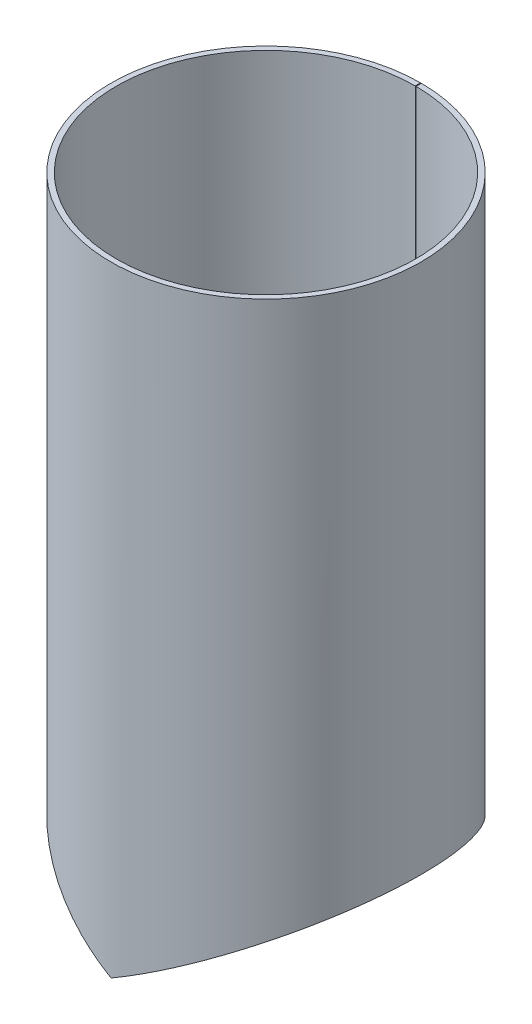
ISO-10303-21;
HEADER;
FILE_DESCRIPTION(('STEP AP214'),'2;1');
FILE_NAME('part.step','',(''),(''),'','','');
FILE_SCHEMA(('AUTOMOTIVE_DESIGN { 1 0 10303 214 1 1 1 1 }'));
ENDSEC;
DATA;
#1=APPLICATION_CONTEXT('core data for automotive mechanical design processes');
#2=APPLICATION_PROTOCOL_DEFINITION('international standard','automotive_design',2000,#1);
#3=PRODUCT_CONTEXT('',#1,'mechanical');
#4=PRODUCT('Part','Part','',(#3));
#5=PRODUCT_RELATED_PRODUCT_CATEGORY('part','',(#4));
#6=PRODUCT_DEFINITION_FORMATION('','',#4);
#7=PRODUCT_DEFINITION_CONTEXT('part definition',#1,'design');
#8=PRODUCT_DEFINITION('design','',#6,#7);
#9=PRODUCT_DEFINITION_SHAPE('','',#8);
#10=(LENGTH_UNIT() NAMED_UNIT(*) SI_UNIT(.MILLI.,.METRE.));
#11=(NAMED_UNIT(*) PLANE_ANGLE_UNIT() SI_UNIT($,.RADIAN.));
#12=(NAMED_UNIT(*) SI_UNIT($,.STERADIAN.) SOLID_ANGLE_UNIT());
#13=UNCERTAINTY_MEASURE_WITH_UNIT(LENGTH_MEASURE(1.E-05),#10,'distance_accuracy_value','');
#14=(GEOMETRIC_REPRESENTATION_CONTEXT(3) GLOBAL_UNCERTAINTY_ASSIGNED_CONTEXT((#13)) GLOBAL_UNIT_ASSIGNED_CONTEXT((#10,
#11,#12)) REPRESENTATION_CONTEXT('',''));
#15=CARTESIAN_POINT('',(0.,0.,0.));
#16=DIRECTION('',(0.,0.,1.));
#17=DIRECTION('',(1.,0.,0.));
#18=AXIS2_PLACEMENT_3D('',#15,#16,#17);
#19=CARTESIAN_POINT('',(-0.500000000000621,0.288675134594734,-174.999285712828));
#20=CARTESIAN_POINT('',(-5.39893127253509,3.11707038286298,-174.985288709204));
#21=CARTESIAN_POINT('',(-9.47554601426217,5.46989984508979,-174.773705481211));
#22=CARTESIAN_POINT('',(-13.540996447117,7.81758832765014,-174.47723647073));
#23=CARTESIAN_POINT('',(-14.3026348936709,8.25744012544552,-174.416005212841));
#24=CARTESIAN_POINT('',(-15.368056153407,8.87268897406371,-174.324266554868));
#25=CARTESIAN_POINT('',(-15.7103576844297,9.07035044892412,-174.293700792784));
#26=CARTESIAN_POINT('',(-16.369311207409,9.45083044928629,-174.233048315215));
#27=CARTESIAN_POINT('',(-16.6842184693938,9.63263752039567,-174.203151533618));
#28=CARTESIAN_POINT('',(-18.2669026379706,10.5463838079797,-174.048667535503));
#29=CARTESIAN_POINT('',(-19.5046444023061,11.2609372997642,-173.913920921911));
#30=CARTESIAN_POINT('',(-23.1323699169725,13.355267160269,-173.481484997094));
#31=CARTESIAN_POINT('',(-25.4368011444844,14.685712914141,-173.155679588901));
#32=CARTESIAN_POINT('',(-28.7223150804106,16.5827203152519,-172.630410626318));
#33=CARTESIAN_POINT('',(-29.7889781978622,17.1986125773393,-172.449207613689));
#34=CARTESIAN_POINT('',(-31.8654262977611,18.3975100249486,-172.077619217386));
#35=CARTESIAN_POINT('',(-32.8716728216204,18.9784527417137,-171.888006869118));
#36=CARTESIAN_POINT('',(-37.8593004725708,21.8579418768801,-170.904107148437));
#37=CARTESIAN_POINT('',(-41.6426773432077,24.0422381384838,-170.013511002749));
#38=CARTESIAN_POINT('',(-47.0074252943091,27.1397399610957,-168.578553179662));
#39=CARTESIAN_POINT('',(-48.7388778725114,28.1394007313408,-168.085360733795));
#40=CARTESIAN_POINT('',(-52.1468700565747,30.1069486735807,-167.059482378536));
#41=CARTESIAN_POINT('',(-53.8188209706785,31.0722146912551,-166.527846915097));
#42=CARTESIAN_POINT('',(-57.0985009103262,32.9657308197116,-165.43201166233));
#43=CARTESIAN_POINT('',(-58.7062306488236,33.8939809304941,-164.867812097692));
#44=CARTESIAN_POINT('',(-61.8575635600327,35.7134652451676,-163.711510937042));
#45=CARTESIAN_POINT('',(-63.3984215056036,36.603096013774,-163.120540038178));
#46=CARTESIAN_POINT('',(-67.9510863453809,39.2315253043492,-161.301988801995));
#47=CARTESIAN_POINT('',(-70.8914406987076,40.9290938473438,-160.02889694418));
#48=CARTESIAN_POINT('',(-76.5823070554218,44.2147956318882,-157.384860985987));
#49=CARTESIAN_POINT('',(-79.3280098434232,45.8000391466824,-156.016726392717));
#50=CARTESIAN_POINT('',(-84.6731433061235,48.8859854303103,-153.181627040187));
#51=CARTESIAN_POINT('',(-87.2686517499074,50.3845156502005,-151.716154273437));
#52=CARTESIAN_POINT('',(-92.3056345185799,53.2926902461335,-148.705342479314));
#53=CARTESIAN_POINT('',(-94.7461318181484,54.7016685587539,-147.161037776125));
#54=CARTESIAN_POINT('',(-99.510330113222,57.4518774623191,-143.982272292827));
#55=CARTESIAN_POINT('',(-101.829305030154,58.7905018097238,-142.350500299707));
#56=CARTESIAN_POINT('',(-108.595922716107,62.6969345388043,-137.344147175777));
#57=CARTESIAN_POINT('',(-112.852929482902,65.1553026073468,-133.858731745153));
#58=CARTESIAN_POINT('',(-118.859997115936,68.623974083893,-128.469984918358));
#59=CARTESIAN_POINT('',(-120.798397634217,69.743054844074,-126.648135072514));
#60=CARTESIAN_POINT('',(-124.572585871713,71.9218126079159,-122.937682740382));
#61=CARTESIAN_POINT('',(-126.405481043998,72.9798555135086,-121.051554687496));
#62=CARTESIAN_POINT('',(-131.740918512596,76.0599763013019,-115.311007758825));
#63=CARTESIAN_POINT('',(-135.08002409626,77.9880462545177,-111.374526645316));
#64=CARTESIAN_POINT('',(-141.323846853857,81.5934983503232,-103.336675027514));
#65=CARTESIAN_POINT('',(-144.226793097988,83.2693244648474,-99.2394917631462));
#66=CARTESIAN_POINT('',(-149.641564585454,86.3950512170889,-90.8693937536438));
#67=CARTESIAN_POINT('',(-152.14793685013,87.8420524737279,-86.6028141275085));
#68=CARTESIAN_POINT('',(-156.758429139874,90.5043307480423,-77.9476554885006));
#69=CARTESIAN_POINT('',(-158.860778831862,91.7184570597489,-73.5633360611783));
#70=CARTESIAN_POINT('',(-162.675206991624,93.9203227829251,-64.6922599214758));
#71=CARTESIAN_POINT('',(-164.390144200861,94.910099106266,-60.197791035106));
#72=CARTESIAN_POINT('',(-167.43385824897,96.6673386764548,-51.1253035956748));
#73=CARTESIAN_POINT('',(-168.762640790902,97.4348019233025,-46.54729316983));
#74=CARTESIAN_POINT('',(-171.035418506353,98.7474153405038,-37.3411976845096));
#75=CARTESIAN_POINT('',(-171.979617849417,99.2923663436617,-32.7147096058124));
#76=CARTESIAN_POINT('',(-174.248148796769,100.601452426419,-18.7495963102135));
#77=CARTESIAN_POINT('',(-175.001808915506,101.037307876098,-9.34416083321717));
#78=CARTESIAN_POINT('',(-174.998184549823,101.035281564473,9.41179417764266));
#79=CARTESIAN_POINT('',(-174.241050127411,100.597331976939,18.8159102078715));
#80=CARTESIAN_POINT('',(-171.966910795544,99.2849972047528,32.7815054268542));
#81=CARTESIAN_POINT('',(-171.020779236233,98.7389764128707,37.4081739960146));
#82=CARTESIAN_POINT('',(-168.744453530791,97.4243426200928,46.613172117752));
#83=CARTESIAN_POINT('',(-167.413847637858,96.6558070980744,51.1908344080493));
#84=CARTESIAN_POINT('',(-164.366269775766,94.8962988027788,60.2629842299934));
#85=CARTESIAN_POINT('',(-162.649291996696,93.9053260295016,64.757463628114));
#86=CARTESIAN_POINT('',(-158.830453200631,91.7009432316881,73.6288558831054));
#87=CARTESIAN_POINT('',(-156.726531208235,90.4859500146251,78.0117953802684));
#88=CARTESIAN_POINT('',(-152.112124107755,87.8213944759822,86.6657227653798));
#89=CARTESIAN_POINT('',(-149.603634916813,86.3731450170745,90.931883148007));
#90=CARTESIAN_POINT('',(-144.184187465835,83.2447027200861,99.301435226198));
#91=CARTESIAN_POINT('',(-141.27894589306,81.5675944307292,103.398064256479));
#92=CARTESIAN_POINT('',(-135.031362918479,77.9599690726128,111.433528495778));
#93=CARTESIAN_POINT('',(-131.690025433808,76.0305715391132,115.3691908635));
#94=CARTESIAN_POINT('',(-126.350552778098,72.9480979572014,121.108901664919));
#95=CARTESIAN_POINT('',(-124.51619819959,71.8892105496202,122.994815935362));
#96=CARTESIAN_POINT('',(-120.738838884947,69.7086433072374,126.704937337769));
#97=CARTESIAN_POINT('',(-118.798882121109,68.5887022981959,128.526502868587));
#98=CARTESIAN_POINT('',(-112.789086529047,65.1185140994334,133.912535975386));
#99=CARTESIAN_POINT('',(-108.529411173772,62.6585561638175,137.396814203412));
#100=CARTESIAN_POINT('',(-101.757239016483,58.7488705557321,142.402049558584));
#101=CARTESIAN_POINT('',(-99.4361545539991,57.4090172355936,144.03354602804));
#102=CARTESIAN_POINT('',(-94.6671829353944,54.6560610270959,147.211873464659));
#103=CARTESIAN_POINT('',(-92.2241589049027,53.2456544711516,148.755905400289));
#104=CARTESIAN_POINT('',(-87.1838041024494,50.335534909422,151.76494713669));
#105=CARTESIAN_POINT('',(-84.5861566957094,48.8357603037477,153.229718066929));
#106=CARTESIAN_POINT('',(-79.235776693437,45.7467814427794,156.063628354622));
#107=CARTESIAN_POINT('',(-76.4878880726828,44.1602911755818,157.430802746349));
#108=CARTESIAN_POINT('',(-70.7923897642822,40.871908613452,160.072771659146));
#109=CARTESIAN_POINT('',(-67.8489234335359,39.1725319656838,161.34505743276));
#110=CARTESIAN_POINT('',(-63.2903336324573,36.5406889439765,163.162525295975));
#111=CARTESIAN_POINT('',(-61.7483322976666,35.6504068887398,163.752746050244));
#112=CARTESIAN_POINT('',(-58.5954440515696,33.8300394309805,164.90722336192));
#113=CARTESIAN_POINT('',(-56.9869855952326,32.9013752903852,165.470462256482));
#114=CARTESIAN_POINT('',(-53.7059525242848,31.0070861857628,166.564285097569));
#115=CARTESIAN_POINT('',(-52.0333771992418,30.0414612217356,167.094868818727));
#116=CARTESIAN_POINT('',(-48.6242468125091,28.0732504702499,168.118559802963));
#117=CARTESIAN_POINT('',(-46.893674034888,27.0740913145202,168.610206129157));
#118=CARTESIAN_POINT('',(-41.5345188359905,23.9797945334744,170.039868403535));
#119=CARTESIAN_POINT('',(-37.7530136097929,21.7965541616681,170.92760727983));
#120=CARTESIAN_POINT('',(-32.765306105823,18.9170338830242,171.908313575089));
#121=CARTESIAN_POINT('',(-31.7601582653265,18.3367361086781,172.097059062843));
#122=CARTESIAN_POINT('',(-29.6900695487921,17.1415239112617,172.466243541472));
#123=CARTESIAN_POINT('',(-28.6257290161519,16.5269717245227,172.646442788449));
#124=CARTESIAN_POINT('',(-25.3445875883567,14.6324769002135,173.169160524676));
#125=CARTESIAN_POINT('',(-23.0396094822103,13.3016959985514,173.493883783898));
#126=CARTESIAN_POINT('',(-19.4057953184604,11.2038481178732,173.924992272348));
#127=CARTESIAN_POINT('',(-18.1651462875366,10.4876194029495,174.059344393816));
#128=CARTESIAN_POINT('',(-16.2602424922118,9.3878571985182,174.244114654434));
#129=CARTESIAN_POINT('',(-15.6302995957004,9.02416869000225,174.30200743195));
#130=CARTESIAN_POINT('',(-14.2268034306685,8.21370835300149,174.422172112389));
#131=CARTESIAN_POINT('',(-13.4664766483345,7.77460503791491,174.483031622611));
#132=CARTESIAN_POINT('',(-9.37137135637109,5.40972272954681,174.779765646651));
#133=CARTESIAN_POINT('',(-5.15493936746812,2.97620373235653,175.));
#134=CARTESIAN_POINT('',(1.21122940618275E-13,0.,175.));
#135=CARTESIAN_POINT('',(-0.482857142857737,0.288675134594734,-168.999310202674));
#136=CARTESIAN_POINT('',(-5.21381628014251,3.11706513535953,-168.985793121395));
#137=CARTESIAN_POINT('',(-9.15067015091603,5.46989984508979,-168.781464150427));
#138=CARTESIAN_POINT('',(-13.0767337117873,7.81758832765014,-168.495159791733));
#139=CARTESIAN_POINT('',(-13.8122588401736,8.25744012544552,-168.436027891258));
#140=CARTESIAN_POINT('',(-14.8411513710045,8.87268897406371,-168.347434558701));
#141=CARTESIAN_POINT('',(-15.171716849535,9.07035044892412,-168.317916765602));
#142=CARTESIAN_POINT('',(-15.8080776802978,9.45083044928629,-168.259343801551));
#143=CARTESIAN_POINT('',(-16.1121881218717,9.63263752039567,-168.230472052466));
#144=CARTESIAN_POINT('',(-17.6406088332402,10.5463838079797,-168.081284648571));
#145=CARTESIAN_POINT('',(-18.8359137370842,11.2609372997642,-167.951157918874));
#146=CARTESIAN_POINT('',(-22.3392600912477,13.355267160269,-167.533548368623));
#147=CARTESIAN_POINT('',(-24.5646822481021,14.685712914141,-167.218913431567));
#148=CARTESIAN_POINT('',(-27.7375499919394,16.5827203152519,-166.711653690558));
#149=CARTESIAN_POINT('',(-28.7676418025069,17.1986125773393,-166.536663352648));
#150=CARTESIAN_POINT('',(-30.7728973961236,18.3975100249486,-166.177815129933));
#151=CARTESIAN_POINT('',(-31.7446440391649,18.9784527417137,-165.994703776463));
#152=CARTESIAN_POINT('',(-36.5612673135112,21.8579418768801,-165.04453776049));
#153=CARTESIAN_POINT('',(-40.2149284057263,24.0422381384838,-164.184476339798));
#154=CARTESIAN_POINT('',(-45.3957421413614,27.1397399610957,-162.798717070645));
#155=CARTESIAN_POINT('',(-47.0678306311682,28.1394007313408,-162.322434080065));
#156=CARTESIAN_POINT('',(-50.3589773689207,30.1069486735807,-161.331728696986));
#157=CARTESIAN_POINT('',(-51.9736042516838,31.0722146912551,-160.818320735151));
#158=CARTESIAN_POINT('',(-55.1408380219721,32.9657308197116,-159.760056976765));
#159=CARTESIAN_POINT('',(-56.6934455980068,33.8939809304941,-159.2152013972));
#160=CARTESIAN_POINT('',(-59.736732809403,35.7134652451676,-158.098544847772));
#161=CARTESIAN_POINT('',(-61.2247613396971,36.603096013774,-157.527835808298));
#162=CARTESIAN_POINT('',(-65.6213348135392,39.2315253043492,-155.771634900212));
#163=CARTESIAN_POINT('',(-68.460877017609,40.9290938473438,-154.542191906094));
#164=CARTESIAN_POINT('',(-73.9566279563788,44.2147956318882,-151.988808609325));
#165=CARTESIAN_POINT('',(-76.6081923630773,45.8000391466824,-150.667581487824));
#166=CARTESIAN_POINT('',(-81.7700641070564,48.8859854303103,-147.929685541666));
#167=CARTESIAN_POINT('',(-84.2765836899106,50.3845156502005,-146.51445755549));
#168=CARTESIAN_POINT('',(-89.1408699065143,53.2926902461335,-143.606873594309));
#169=CARTESIAN_POINT('',(-91.4976930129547,54.7016685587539,-142.115516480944));
#170=CARTESIAN_POINT('',(-96.098547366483,57.4518774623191,-139.045737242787));
#171=CARTESIAN_POINT('',(-98.3380145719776,58.7905018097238,-137.469911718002));
#172=CARTESIAN_POINT('',(-104.872633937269,62.6969345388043,-132.635204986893));
#173=CARTESIAN_POINT('',(-108.983686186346,65.1553026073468,-129.269289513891));
#174=CARTESIAN_POINT('',(-114.784797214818,68.623974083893,-124.065299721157));
#175=CARTESIAN_POINT('',(-116.656738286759,69.743054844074,-122.305913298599));
#176=CARTESIAN_POINT('',(-120.301525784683,71.9218126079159,-118.722676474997));
#177=CARTESIAN_POINT('',(-122.071578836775,72.9798555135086,-116.901215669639));
#178=CARTESIAN_POINT('',(-127.224087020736,76.0599763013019,-111.357487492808));
#179=CARTESIAN_POINT('',(-130.448708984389,77.9880462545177,-107.555971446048));
#180=CARTESIAN_POINT('',(-136.478457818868,81.5934983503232,-99.7937033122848));
#181=CARTESIAN_POINT('',(-139.281874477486,83.2693244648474,-95.8369949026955));
#182=CARTESIAN_POINT('',(-144.51099665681,86.3950512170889,-87.7538716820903));
#183=CARTESIAN_POINT('',(-146.931436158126,87.8420524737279,-83.633574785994));
#184=CARTESIAN_POINT('',(-151.383854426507,90.5043307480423,-75.2751644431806));
#185=CARTESIAN_POINT('',(-153.414123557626,91.7184570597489,-71.0411645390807));
#186=CARTESIAN_POINT('',(-157.09777132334,93.9203227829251,-62.4742395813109));
#187=CARTESIAN_POINT('',(-158.753910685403,94.910099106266,-58.1338667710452));
#188=CARTESIAN_POINT('',(-161.693268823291,96.6673386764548,-49.3724360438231));
#189=CARTESIAN_POINT('',(-162.976493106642,97.4348019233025,-44.9513859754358));
#190=CARTESIAN_POINT('',(-165.171347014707,98.7474153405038,-36.0609280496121));
#191=CARTESIAN_POINT('',(-166.083173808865,99.2923663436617,-31.5930624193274));
#192=CARTESIAN_POINT('',(-168.273926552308,100.601452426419,-18.106753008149));
#193=CARTESIAN_POINT('',(-169.001746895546,101.037307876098,-9.02378960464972));
#194=CARTESIAN_POINT('',(-168.998246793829,101.035281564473,9.08910409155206));
#195=CARTESIAN_POINT('',(-168.2670712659,100.597331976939,18.1707932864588));
#196=CARTESIAN_POINT('',(-166.070902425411,99.2849972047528,31.6575680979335));
#197=CARTESIAN_POINT('',(-165.15720966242,98.7389764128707,36.1256080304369));
#198=CARTESIAN_POINT('',(-162.958929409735,97.4243426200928,45.0150062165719));
#199=CARTESIAN_POINT('',(-161.673944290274,96.6558070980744,49.4357200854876));
#200=CARTESIAN_POINT('',(-158.730854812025,94.8962988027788,58.1968247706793));
#201=CARTESIAN_POINT('',(-157.072744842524,93.9053260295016,62.5372077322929));
#202=CARTESIAN_POINT('',(-153.384837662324,91.7009432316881,71.1044379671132));
#203=CARTESIAN_POINT('',(-151.353050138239,90.4859500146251,75.3371052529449));
#204=CARTESIAN_POINT('',(-146.896851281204,87.8213944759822,83.694326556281));
#205=CARTESIAN_POINT('',(-144.474367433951,86.3731450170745,87.8142185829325));
#206=CARTESIAN_POINT('',(-139.240729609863,83.2447027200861,95.8968145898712));
#207=CARTESIAN_POINT('',(-136.435096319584,81.5675944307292,99.8529877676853));
#208=CARTESIAN_POINT('',(-130.401716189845,77.9599690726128,107.612950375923));
#209=CARTESIAN_POINT('',(-127.174938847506,76.0305715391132,111.41367574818));
#210=CARTESIAN_POINT('',(-122.018533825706,72.9480979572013,116.956596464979));
#211=CARTESIAN_POINT('',(-120.247071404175,71.8892105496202,118.777850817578));
#212=CARTESIAN_POINT('',(-116.599221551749,69.7086433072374,122.360768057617));
#213=CARTESIAN_POINT('',(-114.725777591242,68.5887022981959,124.119879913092));
#214=CARTESIAN_POINT('',(-108.922032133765,65.1185140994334,129.321249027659));
#215=CARTESIAN_POINT('',(-104.808402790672,62.6585561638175,132.686066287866));
#216=CARTESIAN_POINT('',(-98.2684193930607,58.7488705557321,137.519693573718));
#217=CARTESIAN_POINT('',(-96.0269149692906,57.4090172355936,139.095253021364));
#218=CARTESIAN_POINT('',(-91.421450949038,54.6560610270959,142.164609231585));
#219=CARTESIAN_POINT('',(-89.0621877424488,53.2456544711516,143.655702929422));
#220=CARTESIAN_POINT('',(-84.1946451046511,50.335534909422,146.561577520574));
#221=CARTESIAN_POINT('',(-81.6860598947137,48.8357603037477,147.976127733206));
#222=CARTESIAN_POINT('',(-76.5191214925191,45.7467814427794,150.712875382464));
#223=CARTESIAN_POINT('',(-73.8654461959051,44.1602911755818,152.033175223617));
#224=CARTESIAN_POINT('',(-68.3652221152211,40.871908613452,154.584562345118));
#225=CARTESIAN_POINT('',(-65.5226746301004,39.1725319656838,155.813226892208));
#226=CARTESIAN_POINT('',(-61.1203793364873,36.5406889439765,157.568381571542));
#227=CARTESIAN_POINT('',(-59.6312466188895,35.6504068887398,158.138366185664));
#228=CARTESIAN_POINT('',(-56.5864573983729,33.8300394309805,159.253261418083));
#229=CARTESIAN_POINT('',(-55.0331460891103,32.9013752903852,159.797189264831));
#230=CARTESIAN_POINT('',(-51.864605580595,31.0070861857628,160.85350960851));
#231=CARTESIAN_POINT('',(-50.2493756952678,30.0414612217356,161.365901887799));
#232=CARTESIAN_POINT('',(-46.9571297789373,28.0732504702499,162.354494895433));
#233=CARTESIAN_POINT('',(-45.2858909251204,27.0740913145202,162.829284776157));
#234=CARTESIAN_POINT('',(-40.1104781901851,23.9797945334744,164.209930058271));
#235=CARTESIAN_POINT('',(-36.4586245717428,21.7965541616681,165.067232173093));
#236=CARTESIAN_POINT('',(-31.6419241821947,18.9170338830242,166.014314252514));
#237=CARTESIAN_POINT('',(-30.6712385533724,18.3367361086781,166.196588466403));
#238=CARTESIAN_POINT('',(-28.6721243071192,17.1415239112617,166.553115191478));
#239=CARTESIAN_POINT('',(-27.6442754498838,16.5269717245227,166.727136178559));
#240=CARTESIAN_POINT('',(-24.475630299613,14.6324769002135,167.23193216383));
#241=CARTESIAN_POINT('',(-22.2496800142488,13.3016959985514,167.545522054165));
#242=CARTESIAN_POINT('',(-18.7404537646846,11.2038481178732,167.961849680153));
#243=CARTESIAN_POINT('',(-17.5423412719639,10.4876194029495,168.091595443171));
#244=CARTESIAN_POINT('',(-15.7027484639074,9.3878571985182,168.270030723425));
#245=CARTESIAN_POINT('',(-15.0944036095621,9.02416869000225,168.325938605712));
#246=CARTESIAN_POINT('',(-13.7390273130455,8.21370835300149,168.44198335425));
#247=CARTESIAN_POINT('',(-13.0047688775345,7.77460503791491,168.500756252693));
#248=CARTESIAN_POINT('',(-9.05006719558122,5.40972272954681,168.787316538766));
#249=CARTESIAN_POINT('',(-4.97818798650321,2.97619739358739,169.));
#250=CARTESIAN_POINT('',(1.22592516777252E-13,0.,169.));
#251=B_SPLINE_SURFACE_WITH_KNOTS('',1,3,((#19,#20,#21,#22,#23,#24,#25,#26,#27,#28,#29,#30,#31,
#32,#33,#34,#35,#36,#37,#38,#39,#40,#41,#42,#43,#44,#45,#46,#47,#48,#49,#50,#51,#52,#53,#54,#55,
#56,#57,#58,#59,#60,#61,#62,#63,#64,#65,#66,#67,#68,#69,#70,#71,#72,#73,#74,#75,#76,#77,#78,#79,
#80,#81,#82,#83,#84,#85,#86,#87,#88,#89,#90,#91,#92,#93,#94,#95,#96,#97,#98,#99,#100,#101,#102,
#103,#104,#105,#106,#107,#108,#109,#110,#111,#112,#113,#114,#115,#116,#117,#118,#119,#120,#121,
#122,#123,#124,#125,#126,#127,#128,#129,#130,#131,#132,#133,#134),(#135,#136,#137,#138,#139,
#140,#141,#142,#143,#144,#145,#146,#147,#148,#149,#150,#151,#152,#153,#154,#155,#156,#157,#158,
#159,#160,#161,#162,#163,#164,#165,#166,#167,#168,#169,#170,#171,#172,#173,#174,#175,#176,#177,
#178,#179,#180,#181,#182,#183,#184,#185,#186,#187,#188,#189,#190,#191,#192,#193,#194,#195,#196,
#197,#198,#199,#200,#201,#202,#203,#204,#205,#206,#207,#208,#209,#210,#211,#212,#213,#214,#215,
#216,#217,#218,#219,#220,#221,#222,#223,#224,#225,#226,#227,#228,#229,#230,#231,#232,#233,#234,
#235,#236,#237,#238,#239,#240,#241,#242,#243,#244,#245,#246,#247,#248,#249,#250)),.UNSPECIFIED.,
.F.,.F.,.F.,(2,2),(4,2,2,2,2,2,2,2,2,2,2,2,2,2,2,2,2,2,2,2,2,2,2,2,2,2,2,2,2,2,2,2,2,2,2,2,2,2,
2,2,2,2,2,2,2,2,2,2,2,2,2,2,2,2,2,2,2,4),(0.,1.),(0.,0.0078125,0.009765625,0.0107421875,
0.01171875,0.015625,0.0234375,0.02734375,0.03125,0.046875,0.0546875,0.0625,0.0703125,0.078125,
0.09375,0.109375,0.125,0.140625,0.15625,0.1875,0.203125,0.21875,0.25,0.28125,0.3125,0.34375,
0.375,0.40625,0.4375,0.5,0.5625,0.59375,0.625,0.65625,0.6875,0.71875,0.75,0.78125,0.796875,
0.8125,0.84375,0.859375,0.875,0.890625,0.90625,0.921875,0.9296875,0.9375,0.9453125,0.953125,
0.96875,0.97265625,0.9765625,0.984375,0.98828125,0.990234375,0.9921875,1.),.UNSPECIFIED.);
#252=CARTESIAN_POINT('',(-0.500000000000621,0.288675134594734,-174.999285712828));
#253=CARTESIAN_POINT('',(-0.482857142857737,0.288675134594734,-168.999310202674));
#254=B_SPLINE_CURVE_WITH_KNOTS('',1,(#252,#253),.UNSPECIFIED.,.F.,.F.,(2,2),(0.,1.),.UNSPECIFIED.);
#255=CARTESIAN_POINT('',(-0.482857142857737,0.288675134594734,-168.999310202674));
#256=VERTEX_POINT('',#255);
#257=CARTESIAN_POINT('',(-0.500000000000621,0.288675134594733,-174.999285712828));
#258=VERTEX_POINT('',#257);
#259=EDGE_CURVE('E13',#256,#258,#254,.F.);
#260=CARTESIAN_POINT('',(-0.482857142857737,0.288675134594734,-168.999310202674));
#261=CARTESIAN_POINT('',(-5.21381628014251,3.11706513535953,-168.985793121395));
#262=CARTESIAN_POINT('',(-9.15067015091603,5.46989984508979,-168.781464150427));
#263=CARTESIAN_POINT('',(-13.0767337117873,7.81758832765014,-168.495159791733));
#264=CARTESIAN_POINT('',(-13.8122588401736,8.25744012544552,-168.436027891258));
#265=CARTESIAN_POINT('',(-14.8411513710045,8.87268897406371,-168.347434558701));
#266=CARTESIAN_POINT('',(-15.171716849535,9.07035044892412,-168.317916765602));
#267=CARTESIAN_POINT('',(-15.8080776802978,9.45083044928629,-168.259343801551));
#268=CARTESIAN_POINT('',(-16.1121881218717,9.63263752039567,-168.230472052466));
#269=CARTESIAN_POINT('',(-17.6406088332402,10.5463838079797,-168.081284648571));
#270=CARTESIAN_POINT('',(-18.8359137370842,11.2609372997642,-167.951157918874));
#271=CARTESIAN_POINT('',(-22.3392600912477,13.355267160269,-167.533548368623));
#272=CARTESIAN_POINT('',(-24.5646822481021,14.685712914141,-167.218913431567));
#273=CARTESIAN_POINT('',(-27.7375499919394,16.5827203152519,-166.711653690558));
#274=CARTESIAN_POINT('',(-28.7676418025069,17.1986125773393,-166.536663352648));
#275=CARTESIAN_POINT('',(-30.7728973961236,18.3975100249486,-166.177815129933));
#276=CARTESIAN_POINT('',(-31.7446440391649,18.9784527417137,-165.994703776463));
#277=CARTESIAN_POINT('',(-36.5612673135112,21.8579418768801,-165.04453776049));
#278=CARTESIAN_POINT('',(-40.2149284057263,24.0422381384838,-164.184476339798));
#279=CARTESIAN_POINT('',(-45.3957421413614,27.1397399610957,-162.798717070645));
#280=CARTESIAN_POINT('',(-47.0678306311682,28.1394007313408,-162.322434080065));
#281=CARTESIAN_POINT('',(-50.3589773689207,30.1069486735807,-161.331728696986));
#282=CARTESIAN_POINT('',(-51.9736042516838,31.0722146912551,-160.818320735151));
#283=CARTESIAN_POINT('',(-55.1408380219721,32.9657308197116,-159.760056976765));
#284=CARTESIAN_POINT('',(-56.6934455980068,33.8939809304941,-159.2152013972));
#285=CARTESIAN_POINT('',(-59.736732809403,35.7134652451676,-158.098544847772));
#286=CARTESIAN_POINT('',(-61.2247613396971,36.603096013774,-157.527835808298));
#287=CARTESIAN_POINT('',(-65.6213348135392,39.2315253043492,-155.771634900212));
#288=CARTESIAN_POINT('',(-68.460877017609,40.9290938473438,-154.542191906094));
#289=CARTESIAN_POINT('',(-73.9566279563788,44.2147956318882,-151.988808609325));
#290=CARTESIAN_POINT('',(-76.6081923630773,45.8000391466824,-150.667581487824));
#291=CARTESIAN_POINT('',(-81.7700641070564,48.8859854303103,-147.929685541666));
#292=CARTESIAN_POINT('',(-84.2765836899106,50.3845156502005,-146.51445755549));
#293=CARTESIAN_POINT('',(-89.1408699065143,53.2926902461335,-143.606873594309));
#294=CARTESIAN_POINT('',(-91.4976930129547,54.7016685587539,-142.115516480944));
#295=CARTESIAN_POINT('',(-96.098547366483,57.4518774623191,-139.045737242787));
#296=CARTESIAN_POINT('',(-98.3380145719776,58.7905018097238,-137.469911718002));
#297=CARTESIAN_POINT('',(-104.872633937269,62.6969345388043,-132.635204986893));
#298=CARTESIAN_POINT('',(-108.983686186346,65.1553026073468,-129.269289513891));
#299=CARTESIAN_POINT('',(-114.784797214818,68.623974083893,-124.065299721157));
#300=CARTESIAN_POINT('',(-116.656738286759,69.743054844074,-122.305913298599));
#301=CARTESIAN_POINT('',(-120.301525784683,71.9218126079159,-118.722676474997));
#302=CARTESIAN_POINT('',(-122.071578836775,72.9798555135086,-116.901215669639));
#303=CARTESIAN_POINT('',(-127.224087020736,76.0599763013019,-111.357487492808));
#304=CARTESIAN_POINT('',(-130.448708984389,77.9880462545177,-107.555971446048));
#305=CARTESIAN_POINT('',(-136.478457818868,81.5934983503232,-99.7937033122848));
#306=CARTESIAN_POINT('',(-139.281874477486,83.2693244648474,-95.8369949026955));
#307=CARTESIAN_POINT('',(-144.51099665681,86.3950512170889,-87.7538716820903));
#308=CARTESIAN_POINT('',(-146.931436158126,87.8420524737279,-83.633574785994));
#309=CARTESIAN_POINT('',(-151.383854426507,90.5043307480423,-75.2751644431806));
#310=CARTESIAN_POINT('',(-153.414123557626,91.7184570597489,-71.0411645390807));
#311=CARTESIAN_POINT('',(-157.09777132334,93.9203227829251,-62.4742395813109));
#312=CARTESIAN_POINT('',(-158.753910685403,94.910099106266,-58.1338667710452));
#313=CARTESIAN_POINT('',(-161.693268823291,96.6673386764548,-49.3724360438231));
#314=CARTESIAN_POINT('',(-162.976493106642,97.4348019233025,-44.9513859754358));
#315=CARTESIAN_POINT('',(-165.171347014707,98.7474153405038,-36.0609280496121));
#316=CARTESIAN_POINT('',(-166.083173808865,99.2923663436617,-31.5930624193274));
#317=CARTESIAN_POINT('',(-168.273926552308,100.601452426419,-18.106753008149));
#318=CARTESIAN_POINT('',(-169.001746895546,101.037307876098,-9.02378960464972));
#319=CARTESIAN_POINT('',(-168.998246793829,101.035281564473,9.08910409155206));
#320=CARTESIAN_POINT('',(-168.2670712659,100.597331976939,18.1707932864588));
#321=CARTESIAN_POINT('',(-166.070902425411,99.2849972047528,31.6575680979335));
#322=CARTESIAN_POINT('',(-165.15720966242,98.7389764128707,36.1256080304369));
#323=CARTESIAN_POINT('',(-162.958929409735,97.4243426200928,45.0150062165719));
#324=CARTESIAN_POINT('',(-161.673944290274,96.6558070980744,49.4357200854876));
#325=CARTESIAN_POINT('',(-158.730854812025,94.8962988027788,58.1968247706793));
#326=CARTESIAN_POINT('',(-157.072744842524,93.9053260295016,62.5372077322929));
#327=CARTESIAN_POINT('',(-153.384837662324,91.7009432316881,71.1044379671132));
#328=CARTESIAN_POINT('',(-151.353050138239,90.4859500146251,75.3371052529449));
#329=CARTESIAN_POINT('',(-146.896851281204,87.8213944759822,83.694326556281));
#330=CARTESIAN_POINT('',(-144.474367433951,86.3731450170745,87.8142185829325));
#331=CARTESIAN_POINT('',(-139.240729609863,83.2447027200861,95.8968145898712));
#332=CARTESIAN_POINT('',(-136.435096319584,81.5675944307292,99.8529877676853));
#333=CARTESIAN_POINT('',(-130.401716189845,77.9599690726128,107.612950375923));
#334=CARTESIAN_POINT('',(-127.174938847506,76.0305715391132,111.41367574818));
#335=CARTESIAN_POINT('',(-122.018533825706,72.9480979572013,116.956596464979));
#336=CARTESIAN_POINT('',(-120.247071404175,71.8892105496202,118.777850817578));
#337=CARTESIAN_POINT('',(-116.599221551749,69.7086433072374,122.360768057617));
#338=CARTESIAN_POINT('',(-114.725777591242,68.5887022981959,124.119879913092));
#339=CARTESIAN_POINT('',(-108.922032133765,65.1185140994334,129.321249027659));
#340=CARTESIAN_POINT('',(-104.808402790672,62.6585561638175,132.686066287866));
#341=CARTESIAN_POINT('',(-98.2684193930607,58.7488705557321,137.519693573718));
#342=CARTESIAN_POINT('',(-96.0269149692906,57.4090172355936,139.095253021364));
#343=CARTESIAN_POINT('',(-91.421450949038,54.6560610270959,142.164609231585));
#344=CARTESIAN_POINT('',(-89.0621877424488,53.2456544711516,143.655702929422));
#345=CARTESIAN_POINT('',(-84.1946451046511,50.335534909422,146.561577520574));
#346=CARTESIAN_POINT('',(-81.6860598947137,48.8357603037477,147.976127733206));
#347=CARTESIAN_POINT('',(-76.5191214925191,45.7467814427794,150.712875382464));
#348=CARTESIAN_POINT('',(-73.8654461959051,44.1602911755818,152.033175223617));
#349=CARTESIAN_POINT('',(-68.3652221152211,40.871908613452,154.584562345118));
#350=CARTESIAN_POINT('',(-65.5226746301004,39.1725319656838,155.813226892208));
#351=CARTESIAN_POINT('',(-61.1203793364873,36.5406889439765,157.568381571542));
#352=CARTESIAN_POINT('',(-59.6312466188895,35.6504068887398,158.138366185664));
#353=CARTESIAN_POINT('',(-56.5864573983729,33.8300394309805,159.253261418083));
#354=CARTESIAN_POINT('',(-55.0331460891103,32.9013752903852,159.797189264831));
#355=CARTESIAN_POINT('',(-51.864605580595,31.0070861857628,160.85350960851));
#356=CARTESIAN_POINT('',(-50.2493756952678,30.0414612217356,161.365901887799));
#357=CARTESIAN_POINT('',(-46.9571297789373,28.0732504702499,162.354494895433));
#358=CARTESIAN_POINT('',(-45.2858909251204,27.0740913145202,162.829284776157));
#359=CARTESIAN_POINT('',(-40.1104781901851,23.9797945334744,164.209930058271));
#360=CARTESIAN_POINT('',(-36.4586245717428,21.7965541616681,165.067232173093));
#361=CARTESIAN_POINT('',(-31.6419241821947,18.9170338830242,166.014314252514));
#362=CARTESIAN_POINT('',(-30.6712385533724,18.3367361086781,166.196588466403));
#363=CARTESIAN_POINT('',(-28.6721243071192,17.1415239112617,166.553115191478));
#364=CARTESIAN_POINT('',(-27.6442754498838,16.5269717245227,166.727136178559));
#365=CARTESIAN_POINT('',(-24.475630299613,14.6324769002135,167.23193216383));
#366=CARTESIAN_POINT('',(-22.2496800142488,13.3016959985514,167.545522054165));
#367=CARTESIAN_POINT('',(-18.7404537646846,11.2038481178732,167.961849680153));
#368=CARTESIAN_POINT('',(-17.5423412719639,10.4876194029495,168.091595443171));
#369=CARTESIAN_POINT('',(-15.7027484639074,9.3878571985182,168.270030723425));
#370=CARTESIAN_POINT('',(-15.0944036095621,9.02416869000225,168.325938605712));
#371=CARTESIAN_POINT('',(-13.7390273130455,8.21370835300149,168.44198335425));
#372=CARTESIAN_POINT('',(-13.0047688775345,7.77460503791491,168.500756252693));
#373=CARTESIAN_POINT('',(-9.05006719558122,5.40972272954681,168.787316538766));
#374=CARTESIAN_POINT('',(-4.97818798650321,2.97619739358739,169.));
#375=CARTESIAN_POINT('',(1.22592516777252E-13,0.,169.));
#376=B_SPLINE_CURVE_WITH_KNOTS('',3,(#260,#261,#262,#263,#264,#265,#266,#267,#268,#269,#270,
#271,#272,#273,#274,#275,#276,#277,#278,#279,#280,#281,#282,#283,#284,#285,#286,#287,#288,#289,
#290,#291,#292,#293,#294,#295,#296,#297,#298,#299,#300,#301,#302,#303,#304,#305,#306,#307,#308,
#309,#310,#311,#312,#313,#314,#315,#316,#317,#318,#319,#320,#321,#322,#323,#324,#325,#326,#327,
#328,#329,#330,#331,#332,#333,#334,#335,#336,#337,#338,#339,#340,#341,#342,#343,#344,#345,#346,
#347,#348,#349,#350,#351,#352,#353,#354,#355,#356,#357,#358,#359,#360,#361,#362,#363,#364,#365,
#366,#367,#368,#369,#370,#371,#372,#373,#374,#375),.UNSPECIFIED.,.F.,.F.,(4,2,2,2,2,2,2,2,2,2,2,
2,2,2,2,2,2,2,2,2,2,2,2,2,2,2,2,2,2,2,2,2,2,2,2,2,2,2,2,2,2,2,2,2,2,2,2,2,2,2,2,2,2,2,2,2,2,4),
(0.,0.0078125,0.009765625,0.0107421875,0.01171875,0.015625,0.0234375,0.02734375,0.03125,
0.046875,0.0546875,0.0625,0.0703125,0.078125,0.09375,0.109375,0.125,0.140625,0.15625,0.1875,
0.203125,0.21875,0.25,0.28125,0.3125,0.34375,0.375,0.40625,0.4375,0.5,0.5625,0.59375,0.625,
0.65625,0.6875,0.71875,0.75,0.78125,0.796875,0.8125,0.84375,0.859375,0.875,0.890625,0.90625,
0.921875,0.9296875,0.9375,0.9453125,0.953125,0.96875,0.97265625,0.9765625,0.984375,0.98828125,
0.990234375,0.9921875,1.),.UNSPECIFIED.);
#377=CARTESIAN_POINT('',(1.63985578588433E-13,0.,169.));
#378=VERTEX_POINT('',#377);
#379=EDGE_CURVE('E86',#256,#378,#376,.T.);
#380=CARTESIAN_POINT('',(1.22592516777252E-13,0.,169.));
#381=CARTESIAN_POINT('',(1.21122940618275E-13,0.,175.));
#382=B_SPLINE_CURVE_WITH_KNOTS('',1,(#380,#381),.UNSPECIFIED.,.F.,.F.,(2,2),(0.,1.),.UNSPECIFIED.);
#383=CARTESIAN_POINT('',(-4.35217562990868E-07,2.51273231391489E-07,175.));
#384=VERTEX_POINT('',#383);
#385=EDGE_CURVE('E49',#378,#384,#382,.T.);
#386=CARTESIAN_POINT('',(1.21122940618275E-13,0.,175.));
#387=CARTESIAN_POINT('',(-5.15493936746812,2.97620373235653,175.));
#388=CARTESIAN_POINT('',(-9.37137135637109,5.40972272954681,174.779765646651));
#389=CARTESIAN_POINT('',(-13.4664766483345,7.77460503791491,174.483031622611));
#390=CARTESIAN_POINT('',(-14.2268034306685,8.21370835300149,174.422172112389));
#391=CARTESIAN_POINT('',(-15.6302995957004,9.02416869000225,174.30200743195));
#392=CARTESIAN_POINT('',(-16.2602424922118,9.3878571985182,174.244114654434));
#393=CARTESIAN_POINT('',(-18.1651462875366,10.4876194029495,174.059344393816));
#394=CARTESIAN_POINT('',(-19.4057953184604,11.2038481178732,173.924992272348));
#395=CARTESIAN_POINT('',(-23.0396094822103,13.3016959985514,173.493883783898));
#396=CARTESIAN_POINT('',(-25.3445875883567,14.6324769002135,173.169160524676));
#397=CARTESIAN_POINT('',(-28.6257290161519,16.5269717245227,172.646442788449));
#398=CARTESIAN_POINT('',(-29.6900695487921,17.1415239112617,172.466243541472));
#399=CARTESIAN_POINT('',(-31.7601582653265,18.3367361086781,172.097059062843));
#400=CARTESIAN_POINT('',(-32.765306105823,18.9170338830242,171.908313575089));
#401=CARTESIAN_POINT('',(-37.7530136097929,21.7965541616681,170.92760727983));
#402=CARTESIAN_POINT('',(-41.5345188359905,23.9797945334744,170.039868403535));
#403=CARTESIAN_POINT('',(-46.893674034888,27.0740913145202,168.610206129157));
#404=CARTESIAN_POINT('',(-48.6242468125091,28.0732504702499,168.118559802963));
#405=CARTESIAN_POINT('',(-52.0333771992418,30.0414612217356,167.094868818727));
#406=CARTESIAN_POINT('',(-53.7059525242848,31.0070861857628,166.564285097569));
#407=CARTESIAN_POINT('',(-56.9869855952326,32.9013752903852,165.470462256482));
#408=CARTESIAN_POINT('',(-58.5954440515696,33.8300394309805,164.90722336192));
#409=CARTESIAN_POINT('',(-61.7483322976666,35.6504068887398,163.752746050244));
#410=CARTESIAN_POINT('',(-63.2903336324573,36.5406889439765,163.162525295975));
#411=CARTESIAN_POINT('',(-67.8489234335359,39.1725319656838,161.34505743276));
#412=CARTESIAN_POINT('',(-70.7923897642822,40.871908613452,160.072771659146));
#413=CARTESIAN_POINT('',(-76.4878880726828,44.1602911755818,157.430802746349));
#414=CARTESIAN_POINT('',(-79.235776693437,45.7467814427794,156.063628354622));
#415=CARTESIAN_POINT('',(-84.5861566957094,48.8357603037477,153.229718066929));
#416=CARTESIAN_POINT('',(-87.1838041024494,50.335534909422,151.76494713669));
#417=CARTESIAN_POINT('',(-92.2241589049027,53.2456544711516,148.755905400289));
#418=CARTESIAN_POINT('',(-94.6671829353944,54.6560610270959,147.211873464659));
#419=CARTESIAN_POINT('',(-99.4361545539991,57.4090172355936,144.03354602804));
#420=CARTESIAN_POINT('',(-101.757239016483,58.7488705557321,142.402049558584));
#421=CARTESIAN_POINT('',(-108.529411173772,62.6585561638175,137.396814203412));
#422=CARTESIAN_POINT('',(-112.789086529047,65.1185140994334,133.912535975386));
#423=CARTESIAN_POINT('',(-118.798882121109,68.5887022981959,128.526502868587));
#424=CARTESIAN_POINT('',(-120.738838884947,69.7086433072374,126.704937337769));
#425=CARTESIAN_POINT('',(-124.51619819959,71.8892105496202,122.994815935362));
#426=CARTESIAN_POINT('',(-126.350552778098,72.9480979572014,121.108901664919));
#427=CARTESIAN_POINT('',(-131.690025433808,76.0305715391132,115.3691908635));
#428=CARTESIAN_POINT('',(-135.031362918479,77.9599690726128,111.433528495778));
#429=CARTESIAN_POINT('',(-141.27894589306,81.5675944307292,103.398064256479));
#430=CARTESIAN_POINT('',(-144.184187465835,83.2447027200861,99.301435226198));
#431=CARTESIAN_POINT('',(-149.603634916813,86.3731450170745,90.931883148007));
#432=CARTESIAN_POINT('',(-152.112124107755,87.8213944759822,86.6657227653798));
#433=CARTESIAN_POINT('',(-156.726531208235,90.4859500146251,78.0117953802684));
#434=CARTESIAN_POINT('',(-158.830453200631,91.7009432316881,73.6288558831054));
#435=CARTESIAN_POINT('',(-162.649291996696,93.9053260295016,64.757463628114));
#436=CARTESIAN_POINT('',(-164.366269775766,94.8962988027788,60.2629842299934));
#437=CARTESIAN_POINT('',(-167.413847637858,96.6558070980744,51.1908344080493));
#438=CARTESIAN_POINT('',(-168.744453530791,97.4243426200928,46.613172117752));
#439=CARTESIAN_POINT('',(-171.020779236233,98.7389764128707,37.4081739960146));
#440=CARTESIAN_POINT('',(-171.966910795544,99.2849972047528,32.7815054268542));
#441=CARTESIAN_POINT('',(-174.241050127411,100.597331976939,18.8159102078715));
#442=CARTESIAN_POINT('',(-174.998184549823,101.035281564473,9.41179417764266));
#443=CARTESIAN_POINT('',(-175.001808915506,101.037307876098,-9.34416083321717));
#444=CARTESIAN_POINT('',(-174.248148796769,100.601452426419,-18.7495963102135));
#445=CARTESIAN_POINT('',(-171.979617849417,99.2923663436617,-32.7147096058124));
#446=CARTESIAN_POINT('',(-171.035418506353,98.7474153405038,-37.3411976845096));
#447=CARTESIAN_POINT('',(-168.762640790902,97.4348019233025,-46.54729316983));
#448=CARTESIAN_POINT('',(-167.43385824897,96.6673386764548,-51.1253035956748));
#449=CARTESIAN_POINT('',(-164.390144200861,94.910099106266,-60.197791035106));
#450=CARTESIAN_POINT('',(-162.675206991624,93.9203227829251,-64.6922599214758));
#451=CARTESIAN_POINT('',(-158.860778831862,91.7184570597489,-73.5633360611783));
#452=CARTESIAN_POINT('',(-156.758429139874,90.5043307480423,-77.9476554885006));
#453=CARTESIAN_POINT('',(-152.14793685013,87.8420524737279,-86.6028141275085));
#454=CARTESIAN_POINT('',(-149.641564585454,86.3950512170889,-90.8693937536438));
#455=CARTESIAN_POINT('',(-144.226793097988,83.2693244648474,-99.2394917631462));
#456=CARTESIAN_POINT('',(-141.323846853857,81.5934983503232,-103.336675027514));
#457=CARTESIAN_POINT('',(-135.08002409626,77.9880462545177,-111.374526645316));
#458=CARTESIAN_POINT('',(-131.740918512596,76.0599763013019,-115.311007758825));
#459=CARTESIAN_POINT('',(-126.405481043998,72.9798555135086,-121.051554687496));
#460=CARTESIAN_POINT('',(-124.572585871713,71.9218126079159,-122.937682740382));
#461=CARTESIAN_POINT('',(-120.798397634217,69.743054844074,-126.648135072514));
#462=CARTESIAN_POINT('',(-118.859997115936,68.623974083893,-128.469984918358));
#463=CARTESIAN_POINT('',(-112.852929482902,65.1553026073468,-133.858731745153));
#464=CARTESIAN_POINT('',(-108.595922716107,62.6969345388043,-137.344147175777));
#465=CARTESIAN_POINT('',(-101.829305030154,58.7905018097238,-142.350500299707));
#466=CARTESIAN_POINT('',(-99.510330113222,57.4518774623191,-143.982272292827));
#467=CARTESIAN_POINT('',(-94.7461318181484,54.7016685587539,-147.161037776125));
#468=CARTESIAN_POINT('',(-92.3056345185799,53.2926902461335,-148.705342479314));
#469=CARTESIAN_POINT('',(-87.2686517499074,50.3845156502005,-151.716154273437));
#470=CARTESIAN_POINT('',(-84.6731433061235,48.8859854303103,-153.181627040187));
#471=CARTESIAN_POINT('',(-79.3280098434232,45.8000391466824,-156.016726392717));
#472=CARTESIAN_POINT('',(-76.5823070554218,44.2147956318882,-157.384860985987));
#473=CARTESIAN_POINT('',(-70.8914406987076,40.9290938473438,-160.02889694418));
#474=CARTESIAN_POINT('',(-67.9510863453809,39.2315253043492,-161.301988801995));
#475=CARTESIAN_POINT('',(-63.3984215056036,36.603096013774,-163.120540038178));
#476=CARTESIAN_POINT('',(-61.8575635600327,35.7134652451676,-163.711510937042));
#477=CARTESIAN_POINT('',(-58.7062306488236,33.8939809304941,-164.867812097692));
#478=CARTESIAN_POINT('',(-57.0985009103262,32.9657308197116,-165.43201166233));
#479=CARTESIAN_POINT('',(-53.8188209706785,31.0722146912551,-166.527846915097));
#480=CARTESIAN_POINT('',(-52.1468700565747,30.1069486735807,-167.059482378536));
#481=CARTESIAN_POINT('',(-48.7388778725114,28.1394007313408,-168.085360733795));
#482=CARTESIAN_POINT('',(-47.0074252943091,27.1397399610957,-168.578553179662));
#483=CARTESIAN_POINT('',(-41.6426773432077,24.0422381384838,-170.013511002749));
#484=CARTESIAN_POINT('',(-37.8593004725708,21.8579418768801,-170.904107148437));
#485=CARTESIAN_POINT('',(-32.8716728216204,18.9784527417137,-171.888006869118));
#486=CARTESIAN_POINT('',(-31.8654262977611,18.3975100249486,-172.077619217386));
#487=CARTESIAN_POINT('',(-29.7889781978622,17.1986125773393,-172.449207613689));
#488=CARTESIAN_POINT('',(-28.7223150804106,16.5827203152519,-172.630410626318));
#489=CARTESIAN_POINT('',(-25.4368011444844,14.685712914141,-173.155679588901));
#490=CARTESIAN_POINT('',(-23.1323699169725,13.355267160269,-173.481484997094));
#491=CARTESIAN_POINT('',(-19.5046444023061,11.2609372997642,-173.913920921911));
#492=CARTESIAN_POINT('',(-18.2669026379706,10.5463838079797,-174.048667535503));
#493=CARTESIAN_POINT('',(-16.6842184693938,9.63263752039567,-174.203151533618));
#494=CARTESIAN_POINT('',(-16.369311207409,9.45083044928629,-174.233048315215));
#495=CARTESIAN_POINT('',(-15.7103576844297,9.07035044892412,-174.293700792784));
#496=CARTESIAN_POINT('',(-15.368056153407,8.87268897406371,-174.324266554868));
#497=CARTESIAN_POINT('',(-14.3026348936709,8.25744012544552,-174.416005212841));
#498=CARTESIAN_POINT('',(-13.540996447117,7.81758832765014,-174.47723647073));
#499=CARTESIAN_POINT('',(-9.47554601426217,5.46989984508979,-174.773705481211));
#500=CARTESIAN_POINT('',(-5.39893127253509,3.11707038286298,-174.985288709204));
#501=CARTESIAN_POINT('',(-0.500000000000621,0.288675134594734,-174.999285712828));
#502=B_SPLINE_CURVE_WITH_KNOTS('',3,(#386,#387,#388,#389,#390,#391,#392,#393,#394,#395,#396,
#397,#398,#399,#400,#401,#402,#403,#404,#405,#406,#407,#408,#409,#410,#411,#412,#413,#414,#415,
#416,#417,#418,#419,#420,#421,#422,#423,#424,#425,#426,#427,#428,#429,#430,#431,#432,#433,#434,
#435,#436,#437,#438,#439,#440,#441,#442,#443,#444,#445,#446,#447,#448,#449,#450,#451,#452,#453,
#454,#455,#456,#457,#458,#459,#460,#461,#462,#463,#464,#465,#466,#467,#468,#469,#470,#471,#472,
#473,#474,#475,#476,#477,#478,#479,#480,#481,#482,#483,#484,#485,#486,#487,#488,#489,#490,#491,
#492,#493,#494,#495,#496,#497,#498,#499,#500,#501),.UNSPECIFIED.,.F.,.F.,(4,2,2,2,2,2,2,2,2,2,2,
2,2,2,2,2,2,2,2,2,2,2,2,2,2,2,2,2,2,2,2,2,2,2,2,2,2,2,2,2,2,2,2,2,2,2,2,2,2,2,2,2,2,2,2,2,2,4),
(0.,0.0078125,0.009765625,0.01171875,0.015625,0.0234375,0.02734375,0.03125,0.046875,0.0546875,
0.0625,0.0703125,0.078125,0.09375,0.109375,0.125,0.140625,0.15625,0.1875,0.203125,0.21875,0.25,
0.28125,0.3125,0.34375,0.375,0.40625,0.4375,0.5,0.5625,0.59375,0.625,0.65625,0.6875,0.71875,
0.75,0.78125,0.796875,0.8125,0.84375,0.859375,0.875,0.890625,0.90625,0.921875,0.9296875,0.9375,
0.9453125,0.953125,0.96875,0.97265625,0.9765625,0.984375,0.98828125,0.9892578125,0.990234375,
0.9921875,1.),.UNSPECIFIED.);
#503=EDGE_CURVE('E89',#258,#384,#502,.F.);
#504=ORIENTED_EDGE('',*,*,#259,.F.);
#505=ORIENTED_EDGE('',*,*,#379,.T.);
#506=ORIENTED_EDGE('',*,*,#385,.T.);
#507=ORIENTED_EDGE('',*,*,#503,.F.);
#508=EDGE_LOOP('',(#504,#505,#506,#507));
#509=FACE_BOUND('',#508,.T.);
#510=ADVANCED_FACE('F38',(#509),#251,.T.);
#511=CARTESIAN_POINT('',(0.499999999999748,0.288675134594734,-174.999285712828));
#512=CARTESIAN_POINT('',(5.39893535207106,3.11707273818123,-174.985288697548));
#513=CARTESIAN_POINT('',(9.47555270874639,5.4699037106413,-174.773705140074));
#514=CARTESIAN_POINT('',(13.5410045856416,7.81759302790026,-174.477235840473));
#515=CARTESIAN_POINT('',(14.302643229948,8.25744493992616,-174.416004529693));
#516=CARTESIAN_POINT('',(15.3680646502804,8.8726938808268,-174.324265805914));
#517=CARTESIAN_POINT('',(15.710366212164,9.07035537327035,-174.293700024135));
#518=CARTESIAN_POINT('',(16.3693197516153,9.4508353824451,-174.2330475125));
#519=CARTESIAN_POINT('',(16.684227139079,9.63264252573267,-174.203150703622));
#520=CARTESIAN_POINT('',(18.2669122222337,10.5463893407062,-174.048666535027));
#521=CARTESIAN_POINT('',(19.5046546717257,11.2609432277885,-173.913919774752));
#522=CARTESIAN_POINT('',(23.1323821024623,13.3552741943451,-173.481483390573));
#523=CARTESIAN_POINT('',(25.4368144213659,14.6857205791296,-173.155677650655));
#524=CARTESIAN_POINT('',(28.7223297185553,16.5827287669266,-172.630408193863));
#525=CARTESIAN_POINT('',(29.7889932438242,17.1986212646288,-172.449205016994));
#526=CARTESIAN_POINT('',(31.865442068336,18.3975191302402,-172.077616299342));
#527=CARTESIAN_POINT('',(32.8716889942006,18.9784620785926,-171.888003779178));
#528=CARTESIAN_POINT('',(37.8593189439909,21.8579525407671,-170.904103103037));
#529=CARTESIAN_POINT('',(41.642697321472,24.0422496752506,-170.013506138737));
#530=CARTESIAN_POINT('',(47.0074470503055,27.1397525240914,-168.578547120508));
#531=CARTESIAN_POINT('',(48.7389002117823,28.1394136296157,-168.085354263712));
#532=CARTESIAN_POINT('',(52.1468936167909,30.1069622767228,-167.05947503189));
#533=CARTESIAN_POINT('',(53.818845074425,31.0722286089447,-166.527839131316));
#534=CARTESIAN_POINT('',(57.0985259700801,32.9657452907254,-165.43200301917));
#535=CARTESIAN_POINT('',(58.7062561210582,33.893995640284,-164.867803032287));
#536=CARTESIAN_POINT('',(61.8575897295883,35.7134803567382,-163.711501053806));
#537=CARTESIAN_POINT('',(63.3984479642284,36.6031112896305,-163.120529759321));
#538=CARTESIAN_POINT('',(67.9511137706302,39.2315411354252,-161.30197726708));
#539=CARTESIAN_POINT('',(70.8914685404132,40.929109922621,-160.028884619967));
#540=CARTESIAN_POINT('',(76.5823353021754,44.2148119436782,-157.38484725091));
#541=CARTESIAN_POINT('',(79.328038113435,45.8000554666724,-156.016712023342));
#542=CARTESIAN_POINT('',(84.673171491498,48.8860017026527,-153.18161146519));
#543=CARTESIAN_POINT('',(87.2686797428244,50.3845318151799,-151.716138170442));
#544=CARTESIAN_POINT('',(92.3056618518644,53.2927060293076,-148.705325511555));
#545=CARTESIAN_POINT('',(94.7461587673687,54.7016841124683,-147.161020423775));
#546=CARTESIAN_POINT('',(99.5103563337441,57.4518925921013,-143.982254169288));
#547=CARTESIAN_POINT('',(101.829330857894,58.7905167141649,-142.350481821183));
#548=CARTESIAN_POINT('',(108.595947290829,62.6969487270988,-137.344127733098));
#549=CARTESIAN_POINT('',(112.852953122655,65.155316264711,-133.858711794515));
#550=CARTESIAN_POINT('',(118.860019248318,68.623986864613,-128.469964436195));
#551=CARTESIAN_POINT('',(120.798419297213,69.7430673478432,-126.648114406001));
#552=CARTESIAN_POINT('',(124.572606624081,71.9218245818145,-122.937661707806));
#553=CARTESIAN_POINT('',(126.405501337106,72.979867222,-121.051533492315));
#554=CARTESIAN_POINT('',(131.74093742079,76.0599872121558,-115.310986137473));
#555=CARTESIAN_POINT('',(135.0800420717,77.9880566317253,-111.374504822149));
#556=CARTESIAN_POINT('',(141.323862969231,81.5935076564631,-103.336652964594));
#557=CARTESIAN_POINT('',(144.226808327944,83.2693332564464,-99.2394696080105));
#558=CARTESIAN_POINT('',(149.641578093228,86.3950590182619,-90.8693714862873));
#559=CARTESIAN_POINT('',(152.147949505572,87.8420597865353,-86.602791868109));
#560=CARTESIAN_POINT('',(156.758440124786,90.5043370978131,-77.9476333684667));
#561=CARTESIAN_POINT('',(158.860788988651,91.7184629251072,-73.5633140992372));
#562=CARTESIAN_POINT('',(162.675215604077,93.9203277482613,-64.6922382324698));
#563=CARTESIAN_POINT('',(164.390152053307,94.9101036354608,-60.1977695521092));
#564=CARTESIAN_POINT('',(167.433864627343,96.6673423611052,-51.1252826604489));
#565=CARTESIAN_POINT('',(168.762646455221,97.4348051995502,-46.5472725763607));
#566=CARTESIAN_POINT('',(171.035422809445,98.747417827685,-37.3411779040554));
#567=CARTESIAN_POINT('',(171.979621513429,99.2923684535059,-32.7146902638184));
#568=CARTESIAN_POINT('',(174.248150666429,100.601453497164,-18.7495783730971));
#569=CARTESIAN_POINT('',(175.001809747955,101.037308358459,-9.3441440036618));
#570=CARTESIAN_POINT('',(174.998183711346,101.035281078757,9.41180853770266));
#571=CARTESIAN_POINT('',(174.241048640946,100.597331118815,18.8159233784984));
#572=CARTESIAN_POINT('',(171.966908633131,99.2849959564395,32.7815166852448));
#573=CARTESIAN_POINT('',(171.020776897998,98.7389750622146,37.408184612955));
#574=CARTESIAN_POINT('',(168.744450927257,97.4243411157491,46.6131814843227));
#575=CARTESIAN_POINT('',(167.413844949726,96.6558055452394,51.1908431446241));
#576=CARTESIAN_POINT('',(164.366267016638,94.8962972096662,60.262991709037));
#577=CARTESIAN_POINT('',(162.649289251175,93.9053244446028,64.7574704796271));
#578=CARTESIAN_POINT('',(158.830450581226,91.7009417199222,73.6288614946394));
#579=CARTESIAN_POINT('',(156.726528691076,90.4859485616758,78.0118004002));
#580=CARTESIAN_POINT('',(152.112121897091,87.8213931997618,86.6657266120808));
#581=CARTESIAN_POINT('',(149.603632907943,86.3731438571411,90.9318864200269));
#582=CARTESIAN_POINT('',(144.184185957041,83.2447018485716,99.3014373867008));
#583=CARTESIAN_POINT('',(141.278944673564,81.567593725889,103.398065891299));
#584=CARTESIAN_POINT('',(135.031362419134,77.9599687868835,111.433529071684));
#585=CARTESIAN_POINT('',(131.690025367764,76.0305715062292,115.369190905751));
#586=CARTESIAN_POINT('',(126.35055348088,72.9480983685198,121.108900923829));
#587=CARTESIAN_POINT('',(124.516199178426,71.8892111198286,122.994814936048));
#588=CARTESIAN_POINT('',(120.738840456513,69.7086442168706,126.704935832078));
#589=CARTESIAN_POINT('',(118.798884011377,68.5887033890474,128.52650111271));
#590=CARTESIAN_POINT('',(112.789089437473,65.1185157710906,133.912533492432));
#591=CARTESIAN_POINT('',(108.529414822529,62.6585582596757,137.396811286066));
#592=CARTESIAN_POINT('',(101.757243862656,58.7488733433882,142.402046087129));
#593=CARTESIAN_POINT('',(99.4361598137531,57.4090202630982,144.033542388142));
#594=CARTESIAN_POINT('',(94.6671890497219,54.6560645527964,147.21186952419));
#595=CARTESIAN_POINT('',(92.2241654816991,53.2456582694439,148.755901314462));
#596=CARTESIAN_POINT('',(87.183811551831,50.3355392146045,151.764942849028));
#597=CARTESIAN_POINT('',(84.5861645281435,48.8357648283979,153.2297137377));
#598=CARTESIAN_POINT('',(79.2357851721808,45.7467863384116,156.063624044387));
#599=CARTESIAN_POINT('',(76.4878967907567,44.1602962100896,157.430798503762));
#600=CARTESIAN_POINT('',(70.7923992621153,40.8719141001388,160.072767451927));
#601=CARTESIAN_POINT('',(67.8489334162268,39.1725377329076,161.345053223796));
#602=CARTESIAN_POINT('',(63.2903444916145,36.5406952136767,163.162521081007));
#603=CARTESIAN_POINT('',(61.7483435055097,35.650413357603,163.752741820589));
#604=CARTESIAN_POINT('',(58.595455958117,33.8300463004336,164.907219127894));
#605=CARTESIAN_POINT('',(56.986997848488,32.9013823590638,165.470458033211));
#606=CARTESIAN_POINT('',(53.7059654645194,31.0070936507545,166.564280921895));
#607=CARTESIAN_POINT('',(52.0333904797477,30.0414688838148,167.094864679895));
#608=CARTESIAN_POINT('',(48.624260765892,28.0732585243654,168.118555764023));
#609=CARTESIAN_POINT('',(46.8936883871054,27.0740996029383,168.610202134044));
#610=CARTESIAN_POINT('',(41.5345342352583,23.97980342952,170.039864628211));
#611=CARTESIAN_POINT('',(37.7530292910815,21.7965632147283,170.927603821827));
#612=CARTESIAN_POINT('',(32.7653215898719,18.9170428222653,171.908310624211));
#613=CARTESIAN_POINT('',(31.760173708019,18.3367450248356,172.097056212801));
#614=CARTESIAN_POINT('',(29.690085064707,17.1415328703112,172.466240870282));
#615=CARTESIAN_POINT('',(28.625744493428,16.5269806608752,172.646440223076));
#616=CARTESIAN_POINT('',(25.3446027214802,14.6324856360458,173.169158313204));
#617=CARTESIAN_POINT('',(23.0396240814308,13.3017044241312,173.493881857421));
#618=CARTESIAN_POINT('',(19.4058086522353,11.2038558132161,173.924990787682));
#619=CARTESIAN_POINT('',(18.1651591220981,10.4876268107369,174.059343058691));
#620=CARTESIAN_POINT('',(16.2602544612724,9.38786410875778,174.244113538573));
#621=CARTESIAN_POINT('',(15.6303116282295,9.0241756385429,174.302006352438));
#622=CARTESIAN_POINT('',(14.2268157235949,8.21371545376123,174.422171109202));
#623=CARTESIAN_POINT('',(13.4664888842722,7.77461210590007,174.483030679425));
#624=CARTESIAN_POINT('',(9.37138236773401,5.40972908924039,174.779765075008));
#625=CARTESIAN_POINT('',(5.15494638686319,2.9762077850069,175.));
#626=CARTESIAN_POINT('',(1.63985578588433E-13,0.,175.));
#627=CARTESIAN_POINT('',(0.482857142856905,0.288675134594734,-168.999310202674));
#628=CARTESIAN_POINT('',(5.21382021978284,3.11706749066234,-168.985793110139));
#629=CARTESIAN_POINT('',(9.15067661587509,5.4699037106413,-168.781463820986));
#630=CARTESIAN_POINT('',(13.0767415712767,7.81759302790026,-168.495159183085));
#631=CARTESIAN_POINT('',(13.8122668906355,8.25744493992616,-168.436027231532));
#632=CARTESIAN_POINT('',(14.8411595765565,8.8726938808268,-168.347433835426));
#633=CARTESIAN_POINT('',(15.1717250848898,9.07035537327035,-168.317916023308));
#634=CARTESIAN_POINT('',(15.80808593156,9.4508353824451,-168.259343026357));
#635=CARTESIAN_POINT('',(16.1121964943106,9.63264252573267,-168.230471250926));
#636=CARTESIAN_POINT('',(17.6406180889,10.5463893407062,-168.081283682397));
#637=CARTESIAN_POINT('',(18.8359236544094,11.2609432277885,-167.951156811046));
#638=CARTESIAN_POINT('',(22.3392718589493,13.3552741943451,-167.533546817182));
#639=CARTESIAN_POINT('',(24.5646950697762,14.6857205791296,-167.218911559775));
#640=CARTESIAN_POINT('',(27.7375641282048,16.5827287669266,-166.711651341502));
#641=CARTESIAN_POINT('',(28.7676563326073,17.1986212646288,-166.536660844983));
#642=CARTESIAN_POINT('',(30.772912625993,18.3975191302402,-166.177812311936));
#643=CARTESIAN_POINT('',(31.7446596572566,18.9784620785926,-165.994700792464));
#644=CARTESIAN_POINT('',(36.5612851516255,21.8579525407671,-165.04453385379));
#645=CARTESIAN_POINT('',(40.2149476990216,24.0422496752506,-164.184471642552));
#646=CARTESIAN_POINT('',(45.3957631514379,27.1397525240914,-162.798711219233));
#647=CARTESIAN_POINT('',(47.0678522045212,28.1394136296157,-162.322427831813));
#648=CARTESIAN_POINT('',(50.3590001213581,30.1069622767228,-161.331721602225));
#649=CARTESIAN_POINT('',(51.9736275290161,31.0722286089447,-160.818313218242));
#650=CARTESIAN_POINT('',(55.1408622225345,32.9657452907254,-159.760048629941));
#651=CARTESIAN_POINT('',(56.6934701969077,33.893995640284,-159.215192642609));
#652=CARTESIAN_POINT('',(59.7367580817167,35.7134803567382,-158.09853530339));
#653=CARTESIAN_POINT('',(61.2247868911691,36.6031112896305,-157.527825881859));
#654=CARTESIAN_POINT('',(65.6213612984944,39.2315411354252,-155.77162376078));
#655=CARTESIAN_POINT('',(68.4609039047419,40.929109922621,-154.542180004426));
#656=CARTESIAN_POINT('',(73.9566552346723,44.2148119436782,-151.988795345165));
#657=CARTESIAN_POINT('',(76.6082196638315,45.8000554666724,-150.667567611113));
#658=CARTESIAN_POINT('',(81.7700913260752,48.8860017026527,-147.929670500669));
#659=CARTESIAN_POINT('',(84.2766107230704,50.3845318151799,-146.514442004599));
#660=CARTESIAN_POINT('',(89.1408963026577,53.2927060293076,-143.606857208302));
#661=CARTESIAN_POINT('',(91.4977190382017,54.7016841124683,-142.115499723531));
#662=CARTESIAN_POINT('',(96.0985726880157,57.4518925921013,-139.045719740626));
#663=CARTESIAN_POINT('',(98.3380395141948,58.7905167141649,-137.469893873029));
#664=CARTESIAN_POINT('',(104.87265766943,62.6969487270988,-132.63518621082));
#665=CARTESIAN_POINT('',(108.983709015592,65.155316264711,-129.269270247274));
#666=CARTESIAN_POINT('',(114.784818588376,68.623986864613,-124.06527994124));
#667=CARTESIAN_POINT('',(116.656759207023,69.7430673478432,-122.305893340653));
#668=CARTESIAN_POINT('',(120.301545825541,71.9218245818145,-118.722656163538));
#669=CARTESIAN_POINT('',(122.07159843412,72.979867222,-116.90119520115));
#670=CARTESIAN_POINT('',(127.224105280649,76.0599872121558,-111.35746661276));
#671=CARTESIAN_POINT('',(130.448726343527,77.9880566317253,-107.555950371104));
#672=CARTESIAN_POINT('',(136.478473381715,81.5935076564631,-99.7936820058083));
#673=CARTESIAN_POINT('',(139.281889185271,83.2693332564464,-95.8369735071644));
#674=CARTESIAN_POINT('',(144.51100970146,86.3950590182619,-87.753850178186));
#675=CARTESIAN_POINT('',(146.931448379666,87.8420597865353,-83.6335532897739));
#676=CARTESIAN_POINT('',(151.383865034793,90.5043370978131,-75.2751430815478));
#677=CARTESIAN_POINT('',(153.414133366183,91.7184629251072,-71.0411433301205));
#678=CARTESIAN_POINT('',(157.097779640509,93.9203277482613,-62.474218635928));
#679=CARTESIAN_POINT('',(158.753918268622,94.9101036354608,-58.1338460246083));
#680=CARTESIAN_POINT('',(161.693274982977,96.6673423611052,-49.3724158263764));
#681=CARTESIAN_POINT('',(162.976498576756,97.4348051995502,-44.9513660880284));
#682=CARTESIAN_POINT('',(165.171351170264,98.747417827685,-36.0609089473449));
#683=CARTESIAN_POINT('',(166.083177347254,99.2923684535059,-31.5930437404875));
#684=CARTESIAN_POINT('',(168.273928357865,100.601453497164,-18.1067356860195));
#685=CARTESIAN_POINT('',(169.001747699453,101.037308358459,-9.02377335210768));
#686=CARTESIAN_POINT('',(168.9982459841,101.035281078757,9.08911795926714));
#687=CARTESIAN_POINT('',(168.267069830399,100.597331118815,18.1708060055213));
#688=CARTESIAN_POINT('',(166.070900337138,99.2849959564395,31.6575789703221));
#689=CARTESIAN_POINT('',(165.157207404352,98.7389750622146,36.125618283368));
#690=CARTESIAN_POINT('',(162.958926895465,97.4243411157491,45.015015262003));
#691=CARTESIAN_POINT('',(161.673941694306,96.6558055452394,49.4357285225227));
#692=CARTESIAN_POINT('',(158.730852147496,94.8962972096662,58.1968319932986));
#693=CARTESIAN_POINT('',(157.072742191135,93.9053244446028,62.5372143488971));
#694=CARTESIAN_POINT('',(153.384835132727,91.7009417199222,71.1044433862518));
#695=CARTESIAN_POINT('',(151.353047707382,90.4859485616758,75.3371101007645));
#696=CARTESIAN_POINT('',(146.896849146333,87.8213931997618,83.6943302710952));
#697=CARTESIAN_POINT('',(144.474365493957,86.3731438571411,87.8142217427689));
#698=CARTESIAN_POINT('',(139.240728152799,83.2447018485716,95.8968166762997));
#699=CARTESIAN_POINT('',(136.435095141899,81.567593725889,99.8529893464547));
#700=CARTESIAN_POINT('',(130.401715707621,77.9599687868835,107.612950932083));
#701=CARTESIAN_POINT('',(127.174938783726,76.0305715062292,111.413675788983));
#702=CARTESIAN_POINT('',(122.018534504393,72.9480983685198,116.956595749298));
#703=CARTESIAN_POINT('',(120.247072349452,71.8892111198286,118.777849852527));
#704=CARTESIAN_POINT('',(116.599223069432,69.7086442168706,122.36076660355));
#705=CARTESIAN_POINT('',(114.725779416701,68.5887033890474,124.119878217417));
#706=CARTESIAN_POINT('',(108.922034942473,65.1185157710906,129.321246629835));
#707=CARTESIAN_POINT('',(104.808406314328,62.6585582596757,132.686063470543));
#708=CARTESIAN_POINT('',(98.2684240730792,58.7488733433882,137.519690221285));
#709=CARTESIAN_POINT('',(96.0269200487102,57.4090202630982,139.095249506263));
#710=CARTESIAN_POINT('',(91.4214568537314,54.6560645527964,142.164605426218));
#711=CARTESIAN_POINT('',(89.0621940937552,53.2456582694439,143.65569898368));
#712=CARTESIAN_POINT('',(84.1946522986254,50.3355392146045,146.561573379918));
#713=CARTESIAN_POINT('',(81.6860674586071,48.8357648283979,147.976123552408));
#714=CARTESIAN_POINT('',(76.5191296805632,45.7467863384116,150.712871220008));
#715=CARTESIAN_POINT('',(73.8654546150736,44.1602962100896,152.03317112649));
#716=CARTESIAN_POINT('',(68.3652312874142,40.8719141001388,154.584558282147));
#717=CARTESIAN_POINT('',(65.5226842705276,39.1725377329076,155.813222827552));
#718=CARTESIAN_POINT('',(61.1203898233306,36.5406952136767,157.568377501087));
#719=CARTESIAN_POINT('',(59.6312574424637,35.650413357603,158.138362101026));
#720=CARTESIAN_POINT('',(56.5864688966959,33.8300463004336,159.253257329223));
#721=CARTESIAN_POINT('',(55.0331579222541,32.9013823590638,159.797185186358));
#722=CARTESIAN_POINT('',(51.8646180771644,31.0070936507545,160.853505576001));
#723=CARTESIAN_POINT('',(50.2493885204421,30.0414688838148,161.36589789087));
#724=CARTESIAN_POINT('',(46.9571432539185,28.0732585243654,162.354490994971));
#725=CARTESIAN_POINT('',(45.2859047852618,27.0740996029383,162.829280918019));
#726=CARTESIAN_POINT('',(40.110493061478,23.97980342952,164.209926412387));
#727=CARTESIAN_POINT('',(36.4586397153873,21.7965632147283,165.06722883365));
#728=CARTESIAN_POINT('',(31.641939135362,18.9170428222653,166.014311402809));
#729=CARTESIAN_POINT('',(30.6712534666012,18.3367450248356,166.196585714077));
#730=CARTESIAN_POINT('',(28.6721392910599,17.1415328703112,166.553112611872));
#731=CARTESIAN_POINT('',(27.6442903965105,16.5269806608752,166.727133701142));
#732=CARTESIAN_POINT('',(24.4756449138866,14.6324856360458,167.231930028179));
#733=CARTESIAN_POINT('',(22.2496941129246,13.3017044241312,167.545520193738));
#734=CARTESIAN_POINT('',(18.7404666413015,11.2038558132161,167.96184824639));
#735=CARTESIAN_POINT('',(17.5423536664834,10.4876268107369,168.091594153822));
#736=CARTESIAN_POINT('',(15.7027600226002,9.38786410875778,168.270029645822));
#737=CARTESIAN_POINT('',(15.0944152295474,9.0241756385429,168.325937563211));
#738=CARTESIAN_POINT('',(13.7390391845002,8.21371545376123,168.441982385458));
#739=CARTESIAN_POINT('',(13.0047806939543,7.77461210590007,168.500755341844));
#740=CARTESIAN_POINT('',(9.0500778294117,5.40972908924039,168.787315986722));
#741=CARTESIAN_POINT('',(4.97819476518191,2.97620144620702,169.));
#742=CARTESIAN_POINT('',(1.63985578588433E-13,0.,169.));
#743=B_SPLINE_SURFACE_WITH_KNOTS('',1,3,((#511,#512,#513,#514,#515,#516,#517,#518,#519,#520,
#521,#522,#523,#524,#525,#526,#527,#528,#529,#530,#531,#532,#533,#534,#535,#536,#537,#538,#539,
#540,#541,#542,#543,#544,#545,#546,#547,#548,#549,#550,#551,#552,#553,#554,#555,#556,#557,#558,
#559,#560,#561,#562,#563,#564,#565,#566,#567,#568,#569,#570,#571,#572,#573,#574,#575,#576,#577,
#578,#579,#580,#581,#582,#583,#584,#585,#586,#587,#588,#589,#590,#591,#592,#593,#594,#595,#596,
#597,#598,#599,#600,#601,#602,#603,#604,#605,#606,#607,#608,#609,#610,#611,#612,#613,#614,#615,
#616,#617,#618,#619,#620,#621,#622,#623,#624,#625,#626),(#627,#628,#629,#630,#631,#632,#633,
#634,#635,#636,#637,#638,#639,#640,#641,#642,#643,#644,#645,#646,#647,#648,#649,#650,#651,#652,
#653,#654,#655,#656,#657,#658,#659,#660,#661,#662,#663,#664,#665,#666,#667,#668,#669,#670,#671,
#672,#673,#674,#675,#676,#677,#678,#679,#680,#681,#682,#683,#684,#685,#686,#687,#688,#689,#690,
#691,#692,#693,#694,#695,#696,#697,#698,#699,#700,#701,#702,#703,#704,#705,#706,#707,#708,#709,
#710,#711,#712,#713,#714,#715,#716,#717,#718,#719,#720,#721,#722,#723,#724,#725,#726,#727,#728,
#729,#730,#731,#732,#733,#734,#735,#736,#737,#738,#739,#740,#741,#742)),.UNSPECIFIED.,.F.,.F.,
.F.,(2,2),(4,2,2,2,2,2,2,2,2,2,2,2,2,2,2,2,2,2,2,2,2,2,2,2,2,2,2,2,2,2,2,2,2,2,2,2,2,2,2,2,2,2,
2,2,2,2,2,2,2,2,2,2,2,2,2,2,2,4),(0.,1.),(0.,0.0078125,0.009765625,0.0107421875,0.01171875,
0.015625,0.0234375,0.02734375,0.03125,0.046875,0.0546875,0.0625,0.0703125,0.078125,0.09375,
0.109375,0.125,0.140625,0.15625,0.1875,0.203125,0.21875,0.25,0.28125,0.3125,0.34375,0.375,
0.40625,0.4375,0.5,0.5625,0.59375,0.625,0.65625,0.6875,0.71875,0.75,0.78125,0.796875,0.8125,
0.84375,0.859375,0.875,0.890625,0.90625,0.921875,0.9296875,0.9375,0.9453125,0.953125,0.96875,
0.97265625,0.9765625,0.984375,0.98828125,0.990234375,0.9921875,1.),.UNSPECIFIED.);
#744=CARTESIAN_POINT('',(1.63985578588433E-13,0.,169.));
#745=CARTESIAN_POINT('',(4.97819476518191,2.97620144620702,169.));
#746=CARTESIAN_POINT('',(9.0500778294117,5.40972908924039,168.787315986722));
#747=CARTESIAN_POINT('',(13.0047806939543,7.77461210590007,168.500755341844));
#748=CARTESIAN_POINT('',(13.7390391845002,8.21371545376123,168.441982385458));
#749=CARTESIAN_POINT('',(15.0944152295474,9.0241756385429,168.325937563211));
#750=CARTESIAN_POINT('',(15.7027600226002,9.38786410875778,168.270029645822));
#751=CARTESIAN_POINT('',(17.5423536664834,10.4876268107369,168.091594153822));
#752=CARTESIAN_POINT('',(18.7404666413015,11.2038558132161,167.96184824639));
#753=CARTESIAN_POINT('',(22.2496941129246,13.3017044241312,167.545520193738));
#754=CARTESIAN_POINT('',(24.4756449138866,14.6324856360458,167.231930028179));
#755=CARTESIAN_POINT('',(27.6442903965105,16.5269806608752,166.727133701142));
#756=CARTESIAN_POINT('',(28.6721392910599,17.1415328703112,166.553112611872));
#757=CARTESIAN_POINT('',(30.6712534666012,18.3367450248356,166.196585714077));
#758=CARTESIAN_POINT('',(31.641939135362,18.9170428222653,166.014311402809));
#759=CARTESIAN_POINT('',(36.4586397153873,21.7965632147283,165.06722883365));
#760=CARTESIAN_POINT('',(40.110493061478,23.97980342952,164.209926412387));
#761=CARTESIAN_POINT('',(45.2859047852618,27.0740996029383,162.829280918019));
#762=CARTESIAN_POINT('',(46.9571432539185,28.0732585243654,162.354490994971));
#763=CARTESIAN_POINT('',(50.2493885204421,30.0414688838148,161.36589789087));
#764=CARTESIAN_POINT('',(51.8646180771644,31.0070936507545,160.853505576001));
#765=CARTESIAN_POINT('',(55.0331579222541,32.9013823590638,159.797185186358));
#766=CARTESIAN_POINT('',(56.5864688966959,33.8300463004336,159.253257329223));
#767=CARTESIAN_POINT('',(59.6312574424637,35.650413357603,158.138362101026));
#768=CARTESIAN_POINT('',(61.1203898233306,36.5406952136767,157.568377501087));
#769=CARTESIAN_POINT('',(65.5226842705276,39.1725377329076,155.813222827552));
#770=CARTESIAN_POINT('',(68.3652312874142,40.8719141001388,154.584558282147));
#771=CARTESIAN_POINT('',(73.8654546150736,44.1602962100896,152.03317112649));
#772=CARTESIAN_POINT('',(76.5191296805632,45.7467863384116,150.712871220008));
#773=CARTESIAN_POINT('',(81.6860674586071,48.8357648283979,147.976123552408));
#774=CARTESIAN_POINT('',(84.1946522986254,50.3355392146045,146.561573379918));
#775=CARTESIAN_POINT('',(89.0621940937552,53.2456582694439,143.65569898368));
#776=CARTESIAN_POINT('',(91.4214568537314,54.6560645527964,142.164605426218));
#777=CARTESIAN_POINT('',(96.0269200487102,57.4090202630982,139.095249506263));
#778=CARTESIAN_POINT('',(98.2684240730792,58.7488733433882,137.519690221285));
#779=CARTESIAN_POINT('',(104.808406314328,62.6585582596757,132.686063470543));
#780=CARTESIAN_POINT('',(108.922034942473,65.1185157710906,129.321246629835));
#781=CARTESIAN_POINT('',(114.725779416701,68.5887033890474,124.119878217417));
#782=CARTESIAN_POINT('',(116.599223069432,69.7086442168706,122.36076660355));
#783=CARTESIAN_POINT('',(120.247072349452,71.8892111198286,118.777849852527));
#784=CARTESIAN_POINT('',(122.018534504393,72.9480983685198,116.956595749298));
#785=CARTESIAN_POINT('',(127.174938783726,76.0305715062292,111.413675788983));
#786=CARTESIAN_POINT('',(130.401715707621,77.9599687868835,107.612950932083));
#787=CARTESIAN_POINT('',(136.435095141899,81.567593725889,99.8529893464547));
#788=CARTESIAN_POINT('',(139.240728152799,83.2447018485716,95.8968166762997));
#789=CARTESIAN_POINT('',(144.474365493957,86.3731438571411,87.8142217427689));
#790=CARTESIAN_POINT('',(146.896849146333,87.8213931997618,83.6943302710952));
#791=CARTESIAN_POINT('',(151.353047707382,90.4859485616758,75.3371101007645));
#792=CARTESIAN_POINT('',(153.384835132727,91.7009417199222,71.1044433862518));
#793=CARTESIAN_POINT('',(157.072742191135,93.9053244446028,62.5372143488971));
#794=CARTESIAN_POINT('',(158.730852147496,94.8962972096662,58.1968319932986));
#795=CARTESIAN_POINT('',(161.673941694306,96.6558055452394,49.4357285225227));
#796=CARTESIAN_POINT('',(162.958926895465,97.4243411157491,45.015015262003));
#797=CARTESIAN_POINT('',(165.157207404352,98.7389750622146,36.125618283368));
#798=CARTESIAN_POINT('',(166.070900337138,99.2849959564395,31.6575789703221));
#799=CARTESIAN_POINT('',(168.267069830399,100.597331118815,18.1708060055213));
#800=CARTESIAN_POINT('',(168.9982459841,101.035281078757,9.08911795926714));
#801=CARTESIAN_POINT('',(169.001747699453,101.037308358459,-9.02377335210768));
#802=CARTESIAN_POINT('',(168.273928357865,100.601453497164,-18.1067356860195));
#803=CARTESIAN_POINT('',(166.083177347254,99.2923684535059,-31.5930437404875));
#804=CARTESIAN_POINT('',(165.171351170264,98.747417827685,-36.0609089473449));
#805=CARTESIAN_POINT('',(162.976498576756,97.4348051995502,-44.9513660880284));
#806=CARTESIAN_POINT('',(161.693274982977,96.6673423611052,-49.3724158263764));
#807=CARTESIAN_POINT('',(158.753918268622,94.9101036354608,-58.1338460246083));
#808=CARTESIAN_POINT('',(157.097779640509,93.9203277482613,-62.474218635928));
#809=CARTESIAN_POINT('',(153.414133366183,91.7184629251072,-71.0411433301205));
#810=CARTESIAN_POINT('',(151.383865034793,90.5043370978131,-75.2751430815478));
#811=CARTESIAN_POINT('',(146.931448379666,87.8420597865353,-83.6335532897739));
#812=CARTESIAN_POINT('',(144.51100970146,86.3950590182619,-87.753850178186));
#813=CARTESIAN_POINT('',(139.281889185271,83.2693332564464,-95.8369735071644));
#814=CARTESIAN_POINT('',(136.478473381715,81.5935076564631,-99.7936820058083));
#815=CARTESIAN_POINT('',(130.448726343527,77.9880566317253,-107.555950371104));
#816=CARTESIAN_POINT('',(127.224105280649,76.0599872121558,-111.35746661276));
#817=CARTESIAN_POINT('',(122.07159843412,72.979867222,-116.90119520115));
#818=CARTESIAN_POINT('',(120.301545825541,71.9218245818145,-118.722656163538));
#819=CARTESIAN_POINT('',(116.656759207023,69.7430673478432,-122.305893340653));
#820=CARTESIAN_POINT('',(114.784818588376,68.623986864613,-124.06527994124));
#821=CARTESIAN_POINT('',(108.983709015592,65.155316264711,-129.269270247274));
#822=CARTESIAN_POINT('',(104.87265766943,62.6969487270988,-132.63518621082));
#823=CARTESIAN_POINT('',(98.3380395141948,58.7905167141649,-137.469893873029));
#824=CARTESIAN_POINT('',(96.0985726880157,57.4518925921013,-139.045719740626));
#825=CARTESIAN_POINT('',(91.4977190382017,54.7016841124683,-142.115499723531));
#826=CARTESIAN_POINT('',(89.1408963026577,53.2927060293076,-143.606857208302));
#827=CARTESIAN_POINT('',(84.2766107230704,50.3845318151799,-146.514442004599));
#828=CARTESIAN_POINT('',(81.7700913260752,48.8860017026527,-147.929670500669));
#829=CARTESIAN_POINT('',(76.6082196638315,45.8000554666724,-150.667567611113));
#830=CARTESIAN_POINT('',(73.9566552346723,44.2148119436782,-151.988795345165));
#831=CARTESIAN_POINT('',(68.4609039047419,40.929109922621,-154.542180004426));
#832=CARTESIAN_POINT('',(65.6213612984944,39.2315411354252,-155.77162376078));
#833=CARTESIAN_POINT('',(61.2247868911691,36.6031112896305,-157.527825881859));
#834=CARTESIAN_POINT('',(59.7367580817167,35.7134803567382,-158.09853530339));
#835=CARTESIAN_POINT('',(56.6934701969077,33.893995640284,-159.215192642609));
#836=CARTESIAN_POINT('',(55.1408622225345,32.9657452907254,-159.760048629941));
#837=CARTESIAN_POINT('',(51.9736275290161,31.0722286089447,-160.818313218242));
#838=CARTESIAN_POINT('',(50.3590001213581,30.1069622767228,-161.331721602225));
#839=CARTESIAN_POINT('',(47.0678522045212,28.1394136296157,-162.322427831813));
#840=CARTESIAN_POINT('',(45.3957631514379,27.1397525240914,-162.798711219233));
#841=CARTESIAN_POINT('',(40.2149476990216,24.0422496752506,-164.184471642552));
#842=CARTESIAN_POINT('',(36.5612851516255,21.8579525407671,-165.04453385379));
#843=CARTESIAN_POINT('',(31.7446596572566,18.9784620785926,-165.994700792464));
#844=CARTESIAN_POINT('',(30.772912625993,18.3975191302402,-166.177812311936));
#845=CARTESIAN_POINT('',(28.7676563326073,17.1986212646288,-166.536660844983));
#846=CARTESIAN_POINT('',(27.7375641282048,16.5827287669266,-166.711651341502));
#847=CARTESIAN_POINT('',(24.5646950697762,14.6857205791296,-167.218911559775));
#848=CARTESIAN_POINT('',(22.3392718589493,13.3552741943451,-167.533546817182));
#849=CARTESIAN_POINT('',(18.8359236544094,11.2609432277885,-167.951156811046));
#850=CARTESIAN_POINT('',(17.6406180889,10.5463893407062,-168.081283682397));
#851=CARTESIAN_POINT('',(16.1121964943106,9.63264252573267,-168.230471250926));
#852=CARTESIAN_POINT('',(15.80808593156,9.4508353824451,-168.259343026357));
#853=CARTESIAN_POINT('',(15.1717250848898,9.07035537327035,-168.317916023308));
#854=CARTESIAN_POINT('',(14.8411595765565,8.8726938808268,-168.347433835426));
#855=CARTESIAN_POINT('',(13.8122668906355,8.25744493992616,-168.436027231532));
#856=CARTESIAN_POINT('',(13.0767415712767,7.81759302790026,-168.495159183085));
#857=CARTESIAN_POINT('',(9.15067661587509,5.4699037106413,-168.781463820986));
#858=CARTESIAN_POINT('',(5.21382021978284,3.11706749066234,-168.985793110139));
#859=CARTESIAN_POINT('',(0.482857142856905,0.288675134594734,-168.999310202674));
#860=B_SPLINE_CURVE_WITH_KNOTS('',3,(#744,#745,#746,#747,#748,#749,#750,#751,#752,#753,#754,
#755,#756,#757,#758,#759,#760,#761,#762,#763,#764,#765,#766,#767,#768,#769,#770,#771,#772,#773,
#774,#775,#776,#777,#778,#779,#780,#781,#782,#783,#784,#785,#786,#787,#788,#789,#790,#791,#792,
#793,#794,#795,#796,#797,#798,#799,#800,#801,#802,#803,#804,#805,#806,#807,#808,#809,#810,#811,
#812,#813,#814,#815,#816,#817,#818,#819,#820,#821,#822,#823,#824,#825,#826,#827,#828,#829,#830,
#831,#832,#833,#834,#835,#836,#837,#838,#839,#840,#841,#842,#843,#844,#845,#846,#847,#848,#849,
#850,#851,#852,#853,#854,#855,#856,#857,#858,#859),.UNSPECIFIED.,.F.,.F.,(4,2,2,2,2,2,2,2,2,2,2,
2,2,2,2,2,2,2,2,2,2,2,2,2,2,2,2,2,2,2,2,2,2,2,2,2,2,2,2,2,2,2,2,2,2,2,2,2,2,2,2,2,2,2,2,2,2,4),
(0.,0.0078125,0.009765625,0.01171875,0.015625,0.0234375,0.02734375,0.03125,0.046875,0.0546875,
0.0625,0.0703125,0.078125,0.09375,0.109375,0.125,0.140625,0.15625,0.1875,0.203125,0.21875,0.25,
0.28125,0.3125,0.34375,0.375,0.40625,0.4375,0.5,0.5625,0.59375,0.625,0.65625,0.6875,0.71875,
0.75,0.78125,0.796875,0.8125,0.84375,0.859375,0.875,0.890625,0.90625,0.921875,0.9296875,0.9375,
0.9453125,0.953125,0.96875,0.97265625,0.9765625,0.984375,0.98828125,0.9892578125,0.990234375,
0.9921875,1.),.UNSPECIFIED.);
#861=CARTESIAN_POINT('',(0.482857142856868,0.28867513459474,-168.999310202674));
#862=VERTEX_POINT('',#861);
#863=EDGE_CURVE('E100',#862,#378,#860,.F.);
#864=CARTESIAN_POINT('',(0.482857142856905,0.288675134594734,-168.999310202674));
#865=CARTESIAN_POINT('',(0.499999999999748,0.288675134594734,-174.999285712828));
#866=B_SPLINE_CURVE_WITH_KNOTS('',1,(#864,#865),.UNSPECIFIED.,.F.,.F.,(2,2),(0.,1.),.UNSPECIFIED.);
#867=CARTESIAN_POINT('',(0.499999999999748,0.288675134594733,-174.999285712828));
#868=VERTEX_POINT('',#867);
#869=EDGE_CURVE('E242',#862,#868,#866,.T.);
#870=CARTESIAN_POINT('',(0.499999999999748,0.288675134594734,-174.999285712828));
#871=CARTESIAN_POINT('',(5.39893535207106,3.11707273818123,-174.985288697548));
#872=CARTESIAN_POINT('',(9.47555270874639,5.4699037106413,-174.773705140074));
#873=CARTESIAN_POINT('',(13.5410045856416,7.81759302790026,-174.477235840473));
#874=CARTESIAN_POINT('',(14.302643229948,8.25744493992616,-174.416004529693));
#875=CARTESIAN_POINT('',(15.3680646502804,8.8726938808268,-174.324265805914));
#876=CARTESIAN_POINT('',(15.710366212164,9.07035537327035,-174.293700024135));
#877=CARTESIAN_POINT('',(16.3693197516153,9.4508353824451,-174.2330475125));
#878=CARTESIAN_POINT('',(16.684227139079,9.63264252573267,-174.203150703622));
#879=CARTESIAN_POINT('',(18.2669122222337,10.5463893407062,-174.048666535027));
#880=CARTESIAN_POINT('',(19.5046546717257,11.2609432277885,-173.913919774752));
#881=CARTESIAN_POINT('',(23.1323821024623,13.3552741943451,-173.481483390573));
#882=CARTESIAN_POINT('',(25.4368144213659,14.6857205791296,-173.155677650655));
#883=CARTESIAN_POINT('',(28.7223297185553,16.5827287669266,-172.630408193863));
#884=CARTESIAN_POINT('',(29.7889932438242,17.1986212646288,-172.449205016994));
#885=CARTESIAN_POINT('',(31.865442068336,18.3975191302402,-172.077616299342));
#886=CARTESIAN_POINT('',(32.8716889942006,18.9784620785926,-171.888003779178));
#887=CARTESIAN_POINT('',(37.8593189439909,21.8579525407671,-170.904103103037));
#888=CARTESIAN_POINT('',(41.642697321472,24.0422496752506,-170.013506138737));
#889=CARTESIAN_POINT('',(47.0074470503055,27.1397525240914,-168.578547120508));
#890=CARTESIAN_POINT('',(48.7389002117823,28.1394136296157,-168.085354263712));
#891=CARTESIAN_POINT('',(52.1468936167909,30.1069622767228,-167.05947503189));
#892=CARTESIAN_POINT('',(53.818845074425,31.0722286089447,-166.527839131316));
#893=CARTESIAN_POINT('',(57.0985259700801,32.9657452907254,-165.43200301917));
#894=CARTESIAN_POINT('',(58.7062561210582,33.893995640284,-164.867803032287));
#895=CARTESIAN_POINT('',(61.8575897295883,35.7134803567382,-163.711501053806));
#896=CARTESIAN_POINT('',(63.3984479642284,36.6031112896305,-163.120529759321));
#897=CARTESIAN_POINT('',(67.9511137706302,39.2315411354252,-161.30197726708));
#898=CARTESIAN_POINT('',(70.8914685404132,40.929109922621,-160.028884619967));
#899=CARTESIAN_POINT('',(76.5823353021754,44.2148119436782,-157.38484725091));
#900=CARTESIAN_POINT('',(79.328038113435,45.8000554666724,-156.016712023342));
#901=CARTESIAN_POINT('',(84.673171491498,48.8860017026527,-153.18161146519));
#902=CARTESIAN_POINT('',(87.2686797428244,50.3845318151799,-151.716138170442));
#903=CARTESIAN_POINT('',(92.3056618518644,53.2927060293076,-148.705325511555));
#904=CARTESIAN_POINT('',(94.7461587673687,54.7016841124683,-147.161020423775));
#905=CARTESIAN_POINT('',(99.5103563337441,57.4518925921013,-143.982254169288));
#906=CARTESIAN_POINT('',(101.829330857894,58.7905167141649,-142.350481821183));
#907=CARTESIAN_POINT('',(108.595947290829,62.6969487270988,-137.344127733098));
#908=CARTESIAN_POINT('',(112.852953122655,65.155316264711,-133.858711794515));
#909=CARTESIAN_POINT('',(118.860019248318,68.623986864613,-128.469964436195));
#910=CARTESIAN_POINT('',(120.798419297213,69.7430673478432,-126.648114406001));
#911=CARTESIAN_POINT('',(124.572606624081,71.9218245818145,-122.937661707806));
#912=CARTESIAN_POINT('',(126.405501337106,72.979867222,-121.051533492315));
#913=CARTESIAN_POINT('',(131.74093742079,76.0599872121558,-115.310986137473));
#914=CARTESIAN_POINT('',(135.0800420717,77.9880566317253,-111.374504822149));
#915=CARTESIAN_POINT('',(141.323862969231,81.5935076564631,-103.336652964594));
#916=CARTESIAN_POINT('',(144.226808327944,83.2693332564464,-99.2394696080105));
#917=CARTESIAN_POINT('',(149.641578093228,86.3950590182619,-90.8693714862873));
#918=CARTESIAN_POINT('',(152.147949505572,87.8420597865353,-86.602791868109));
#919=CARTESIAN_POINT('',(156.758440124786,90.5043370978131,-77.9476333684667));
#920=CARTESIAN_POINT('',(158.860788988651,91.7184629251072,-73.5633140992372));
#921=CARTESIAN_POINT('',(162.675215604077,93.9203277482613,-64.6922382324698));
#922=CARTESIAN_POINT('',(164.390152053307,94.9101036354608,-60.1977695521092));
#923=CARTESIAN_POINT('',(167.433864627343,96.6673423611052,-51.1252826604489));
#924=CARTESIAN_POINT('',(168.762646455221,97.4348051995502,-46.5472725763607));
#925=CARTESIAN_POINT('',(171.035422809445,98.747417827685,-37.3411779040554));
#926=CARTESIAN_POINT('',(171.979621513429,99.2923684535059,-32.7146902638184));
#927=CARTESIAN_POINT('',(174.248150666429,100.601453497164,-18.7495783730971));
#928=CARTESIAN_POINT('',(175.001809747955,101.037308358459,-9.3441440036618));
#929=CARTESIAN_POINT('',(174.998183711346,101.035281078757,9.41180853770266));
#930=CARTESIAN_POINT('',(174.241048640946,100.597331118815,18.8159233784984));
#931=CARTESIAN_POINT('',(171.966908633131,99.2849959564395,32.7815166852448));
#932=CARTESIAN_POINT('',(171.020776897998,98.7389750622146,37.408184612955));
#933=CARTESIAN_POINT('',(168.744450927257,97.4243411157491,46.6131814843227));
#934=CARTESIAN_POINT('',(167.413844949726,96.6558055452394,51.1908431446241));
#935=CARTESIAN_POINT('',(164.366267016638,94.8962972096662,60.262991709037));
#936=CARTESIAN_POINT('',(162.649289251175,93.9053244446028,64.7574704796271));
#937=CARTESIAN_POINT('',(158.830450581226,91.7009417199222,73.6288614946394));
#938=CARTESIAN_POINT('',(156.726528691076,90.4859485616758,78.0118004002));
#939=CARTESIAN_POINT('',(152.112121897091,87.8213931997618,86.6657266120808));
#940=CARTESIAN_POINT('',(149.603632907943,86.3731438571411,90.9318864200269));
#941=CARTESIAN_POINT('',(144.184185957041,83.2447018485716,99.3014373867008));
#942=CARTESIAN_POINT('',(141.278944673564,81.567593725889,103.398065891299));
#943=CARTESIAN_POINT('',(135.031362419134,77.9599687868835,111.433529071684));
#944=CARTESIAN_POINT('',(131.690025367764,76.0305715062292,115.369190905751));
#945=CARTESIAN_POINT('',(126.35055348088,72.9480983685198,121.108900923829));
#946=CARTESIAN_POINT('',(124.516199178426,71.8892111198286,122.994814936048));
#947=CARTESIAN_POINT('',(120.738840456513,69.7086442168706,126.704935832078));
#948=CARTESIAN_POINT('',(118.798884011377,68.5887033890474,128.52650111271));
#949=CARTESIAN_POINT('',(112.789089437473,65.1185157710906,133.912533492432));
#950=CARTESIAN_POINT('',(108.529414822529,62.6585582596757,137.396811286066));
#951=CARTESIAN_POINT('',(101.757243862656,58.7488733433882,142.402046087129));
#952=CARTESIAN_POINT('',(99.4361598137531,57.4090202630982,144.033542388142));
#953=CARTESIAN_POINT('',(94.6671890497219,54.6560645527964,147.21186952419));
#954=CARTESIAN_POINT('',(92.2241654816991,53.2456582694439,148.755901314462));
#955=CARTESIAN_POINT('',(87.183811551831,50.3355392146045,151.764942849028));
#956=CARTESIAN_POINT('',(84.5861645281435,48.8357648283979,153.2297137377));
#957=CARTESIAN_POINT('',(79.2357851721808,45.7467863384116,156.063624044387));
#958=CARTESIAN_POINT('',(76.4878967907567,44.1602962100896,157.430798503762));
#959=CARTESIAN_POINT('',(70.7923992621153,40.8719141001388,160.072767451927));
#960=CARTESIAN_POINT('',(67.8489334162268,39.1725377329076,161.345053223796));
#961=CARTESIAN_POINT('',(63.2903444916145,36.5406952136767,163.162521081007));
#962=CARTESIAN_POINT('',(61.7483435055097,35.650413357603,163.752741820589));
#963=CARTESIAN_POINT('',(58.595455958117,33.8300463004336,164.907219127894));
#964=CARTESIAN_POINT('',(56.986997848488,32.9013823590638,165.470458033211));
#965=CARTESIAN_POINT('',(53.7059654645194,31.0070936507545,166.564280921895));
#966=CARTESIAN_POINT('',(52.0333904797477,30.0414688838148,167.094864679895));
#967=CARTESIAN_POINT('',(48.624260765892,28.0732585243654,168.118555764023));
#968=CARTESIAN_POINT('',(46.8936883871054,27.0740996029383,168.610202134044));
#969=CARTESIAN_POINT('',(41.5345342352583,23.97980342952,170.039864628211));
#970=CARTESIAN_POINT('',(37.7530292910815,21.7965632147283,170.927603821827));
#971=CARTESIAN_POINT('',(32.7653215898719,18.9170428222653,171.908310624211));
#972=CARTESIAN_POINT('',(31.760173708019,18.3367450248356,172.097056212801));
#973=CARTESIAN_POINT('',(29.690085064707,17.1415328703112,172.466240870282));
#974=CARTESIAN_POINT('',(28.625744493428,16.5269806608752,172.646440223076));
#975=CARTESIAN_POINT('',(25.3446027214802,14.6324856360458,173.169158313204));
#976=CARTESIAN_POINT('',(23.0396240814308,13.3017044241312,173.493881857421));
#977=CARTESIAN_POINT('',(19.4058086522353,11.2038558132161,173.924990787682));
#978=CARTESIAN_POINT('',(18.1651591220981,10.4876268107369,174.059343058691));
#979=CARTESIAN_POINT('',(16.2602544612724,9.38786410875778,174.244113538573));
#980=CARTESIAN_POINT('',(15.6303116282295,9.0241756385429,174.302006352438));
#981=CARTESIAN_POINT('',(14.2268157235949,8.21371545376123,174.422171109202));
#982=CARTESIAN_POINT('',(13.4664888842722,7.77461210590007,174.483030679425));
#983=CARTESIAN_POINT('',(9.37138236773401,5.40972908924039,174.779765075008));
#984=CARTESIAN_POINT('',(5.15494638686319,2.9762077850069,175.));
#985=CARTESIAN_POINT('',(1.63985578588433E-13,0.,175.));
#986=B_SPLINE_CURVE_WITH_KNOTS('',3,(#870,#871,#872,#873,#874,#875,#876,#877,#878,#879,#880,
#881,#882,#883,#884,#885,#886,#887,#888,#889,#890,#891,#892,#893,#894,#895,#896,#897,#898,#899,
#900,#901,#902,#903,#904,#905,#906,#907,#908,#909,#910,#911,#912,#913,#914,#915,#916,#917,#918,
#919,#920,#921,#922,#923,#924,#925,#926,#927,#928,#929,#930,#931,#932,#933,#934,#935,#936,#937,
#938,#939,#940,#941,#942,#943,#944,#945,#946,#947,#948,#949,#950,#951,#952,#953,#954,#955,#956,
#957,#958,#959,#960,#961,#962,#963,#964,#965,#966,#967,#968,#969,#970,#971,#972,#973,#974,#975,
#976,#977,#978,#979,#980,#981,#982,#983,#984,#985),.UNSPECIFIED.,.F.,.F.,(4,2,2,2,2,2,2,2,2,2,2,
2,2,2,2,2,2,2,2,2,2,2,2,2,2,2,2,2,2,2,2,2,2,2,2,2,2,2,2,2,2,2,2,2,2,2,2,2,2,2,2,2,2,2,2,2,2,4),
(0.,0.0078125,0.009765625,0.0107421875,0.01171875,0.015625,0.0234375,0.02734375,0.03125,
0.046875,0.0546875,0.0625,0.0703125,0.078125,0.09375,0.109375,0.125,0.140625,0.15625,0.1875,
0.203125,0.21875,0.25,0.28125,0.3125,0.34375,0.375,0.40625,0.4375,0.5,0.5625,0.59375,0.625,
0.65625,0.6875,0.71875,0.75,0.78125,0.796875,0.8125,0.84375,0.859375,0.875,0.890625,0.90625,
0.921875,0.9296875,0.9375,0.9453125,0.953125,0.96875,0.97265625,0.9765625,0.984375,0.98828125,
0.990234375,0.9921875,1.),.UNSPECIFIED.);
#987=EDGE_CURVE('E214',#868,#384,#986,.T.);
#988=ORIENTED_EDGE('',*,*,#385,.F.);
#989=ORIENTED_EDGE('',*,*,#863,.F.);
#990=ORIENTED_EDGE('',*,*,#869,.T.);
#991=ORIENTED_EDGE('',*,*,#987,.T.);
#992=EDGE_LOOP('',(#988,#989,#990,#991));
#993=FACE_BOUND('',#992,.T.);
#994=ADVANCED_FACE('F129',(#993),#743,.F.);
#995=CARTESIAN_POINT('',(0.482857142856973,350.144337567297,-168.999310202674));
#996=DIRECTION('',(0.999995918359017,0.,0.00285714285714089));
#997=DIRECTION('',(0.,-1.,0.));
#998=AXIS2_PLACEMENT_3D('',#995,#996,#997);
#999=PLANE('',#998);
#1000=ORIENTED_EDGE('',*,*,#869,.F.);
#1001=DIRECTION('',(0.,-1.,0.));
#1002=VECTOR('',#1001,1.);
#1003=CARTESIAN_POINT('',(0.482857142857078,700.,-168.999310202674));
#1004=LINE('',#1003,#1002);
#1005=CARTESIAN_POINT('',(0.48285714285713,700.,-168.999310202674));
#1006=VERTEX_POINT('',#1005);
#1007=EDGE_CURVE('E246',#1006,#862,#1004,.T.);
#1008=ORIENTED_EDGE('',*,*,#1007,.F.);
#1009=DIRECTION('',(0.00285714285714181,0.,-0.999995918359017));
#1010=VECTOR('',#1009,1.);
#1011=CARTESIAN_POINT('',(0.48285714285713,700.,-168.999310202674));
#1012=LINE('',#1011,#1010);
#1013=CARTESIAN_POINT('',(0.499999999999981,700.,-174.999285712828));
#1014=VERTEX_POINT('',#1013);
#1015=EDGE_CURVE('E237',#1006,#1014,#1012,.T.);
#1016=ORIENTED_EDGE('',*,*,#1015,.T.);
#1017=DIRECTION('',(0.,1.,0.));
#1018=VECTOR('',#1017,1.);
#1019=CARTESIAN_POINT('',(0.499999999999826,-1270.77460344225,-174.999285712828));
#1020=LINE('',#1019,#1018);
#1021=EDGE_CURVE('E108',#1014,#868,#1020,.F.);
#1022=ORIENTED_EDGE('',*,*,#1021,.T.);
#1023=EDGE_LOOP('',(#1000,#1008,#1016,#1022));
#1024=FACE_BOUND('',#1023,.T.);
#1025=ADVANCED_FACE('F174',(#1024),#999,.F.);
#1026=CARTESIAN_POINT('',(1.63985578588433E-13,700.,0.));
#1027=DIRECTION('',(0.,-1.,0.));
#1028=DIRECTION('',(0.,0.,-1.));
#1029=AXIS2_PLACEMENT_3D('',#1026,#1027,#1028);
#1030=PLANE('',#1029);
#1031=ORIENTED_EDGE('',*,*,#1015,.F.);
#1032=CARTESIAN_POINT('',(1.63985578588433E-13,700.,0.));
#1033=DIRECTION('',(0.,1.,0.));
#1034=DIRECTION('',(0.,0.,1.));
#1035=AXIS2_PLACEMENT_3D('',#1032,#1033,#1034);
#1036=CIRCLE('',#1035,169.);
#1037=CARTESIAN_POINT('',(-0.48285714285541,700.,-168.999310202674));
#1038=VERTEX_POINT('',#1037);
#1039=EDGE_CURVE('E245',#1038,#1006,#1036,.T.);
#1040=ORIENTED_EDGE('',*,*,#1039,.F.);
#1041=DIRECTION('',(-0.00285714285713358,0.,-0.999995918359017));
#1042=VECTOR('',#1041,1.);
#1043=CARTESIAN_POINT('',(-0.48285714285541,700.,-168.999310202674));
#1044=LINE('',#1043,#1042);
#1045=CARTESIAN_POINT('',(-0.499999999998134,700.,-174.999285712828));
#1046=VERTEX_POINT('',#1045);
#1047=EDGE_CURVE('E43',#1038,#1046,#1044,.T.);
#1048=ORIENTED_EDGE('',*,*,#1047,.T.);
#1049=CARTESIAN_POINT('',(1.63985578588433E-13,700.,0.));
#1050=DIRECTION('',(0.,1.,0.));
#1051=DIRECTION('',(0.,0.,1.));
#1052=AXIS2_PLACEMENT_3D('',#1049,#1050,#1051);
#1053=CIRCLE('',#1052,175.);
#1054=EDGE_CURVE('E105',#1046,#1014,#1053,.T.);
#1055=ORIENTED_EDGE('',*,*,#1054,.T.);
#1056=EDGE_LOOP('',(#1031,#1040,#1048,#1055));
#1057=FACE_BOUND('',#1056,.T.);
#1058=ADVANCED_FACE('F183',(#1057),#1030,.F.);
#1059=CARTESIAN_POINT('',(-0.482857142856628,350.144337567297,-168.999310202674));
#1060=DIRECTION('',(0.999995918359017,0.,-0.00285714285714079));
#1061=DIRECTION('',(0.,-1.,0.));
#1062=AXIS2_PLACEMENT_3D('',#1059,#1060,#1061);
#1063=PLANE('',#1062);
#1064=DIRECTION('',(0.,-1.,0.));
#1065=VECTOR('',#1064,1.);
#1066=CARTESIAN_POINT('',(-0.482857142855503,700.,-168.999310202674));
#1067=LINE('',#1066,#1065);
#1068=EDGE_CURVE('E98',#1038,#256,#1067,.T.);
#1069=ORIENTED_EDGE('',*,*,#1068,.T.);
#1070=ORIENTED_EDGE('',*,*,#259,.T.);
#1071=DIRECTION('',(0.,1.,0.));
#1072=VECTOR('',#1071,1.);
#1073=CARTESIAN_POINT('',(-0.499999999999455,-1270.77460344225,-174.999285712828));
#1074=LINE('',#1073,#1072);
#1075=EDGE_CURVE('E234',#1046,#258,#1074,.F.);
#1076=ORIENTED_EDGE('',*,*,#1075,.F.);
#1077=ORIENTED_EDGE('',*,*,#1047,.F.);
#1078=EDGE_LOOP('',(#1069,#1070,#1076,#1077));
#1079=FACE_BOUND('',#1078,.T.);
#1080=ADVANCED_FACE('F40',(#1079),#1063,.T.);
#1081=CARTESIAN_POINT('',(1.63985578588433E-13,-1270.77460344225,0.));
#1082=DIRECTION('',(0.,1.,0.));
#1083=DIRECTION('',(0.,0.,1.));
#1084=AXIS2_PLACEMENT_3D('',#1081,#1082,#1083);
#1085=CYLINDRICAL_SURFACE('',#1084,175.);
#1086=ORIENTED_EDGE('',*,*,#1054,.F.);
#1087=ORIENTED_EDGE('',*,*,#1075,.T.);
#1088=ORIENTED_EDGE('',*,*,#503,.T.);
#1089=ORIENTED_EDGE('',*,*,#987,.F.);
#1090=ORIENTED_EDGE('',*,*,#1021,.F.);
#1091=EDGE_LOOP('',(#1086,#1087,#1088,#1089,#1090));
#1092=FACE_BOUND('',#1091,.T.);
#1093=ADVANCED_FACE('F187',(#1092),#1085,.T.);
#1094=CARTESIAN_POINT('',(1.63985578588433E-13,-1270.77460344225,0.));
#1095=DIRECTION('',(0.,1.,0.));
#1096=DIRECTION('',(0.,0.,1.));
#1097=AXIS2_PLACEMENT_3D('',#1094,#1095,#1096);
#1098=CYLINDRICAL_SURFACE('',#1097,169.);
#1099=ORIENTED_EDGE('',*,*,#1039,.T.);
#1100=ORIENTED_EDGE('',*,*,#1007,.T.);
#1101=ORIENTED_EDGE('',*,*,#863,.T.);
#1102=ORIENTED_EDGE('',*,*,#379,.F.);
#1103=ORIENTED_EDGE('',*,*,#1068,.F.);
#1104=EDGE_LOOP('',(#1099,#1100,#1101,#1102,#1103));
#1105=FACE_BOUND('',#1104,.T.);
#1106=ADVANCED_FACE('F97',(#1105),#1098,.F.);
#1107=CLOSED_SHELL('',(#510,#994,#1025,#1058,#1080,#1093,#1106));
#1108=MANIFOLD_SOLID_BREP('B2',#1107);
#1109=ADVANCED_BREP_SHAPE_REPRESENTATION('',(#18,#1108),#14);
#1110=SHAPE_DEFINITION_REPRESENTATION(#9,#1109);
ENDSEC;
END-ISO-10303-21;
